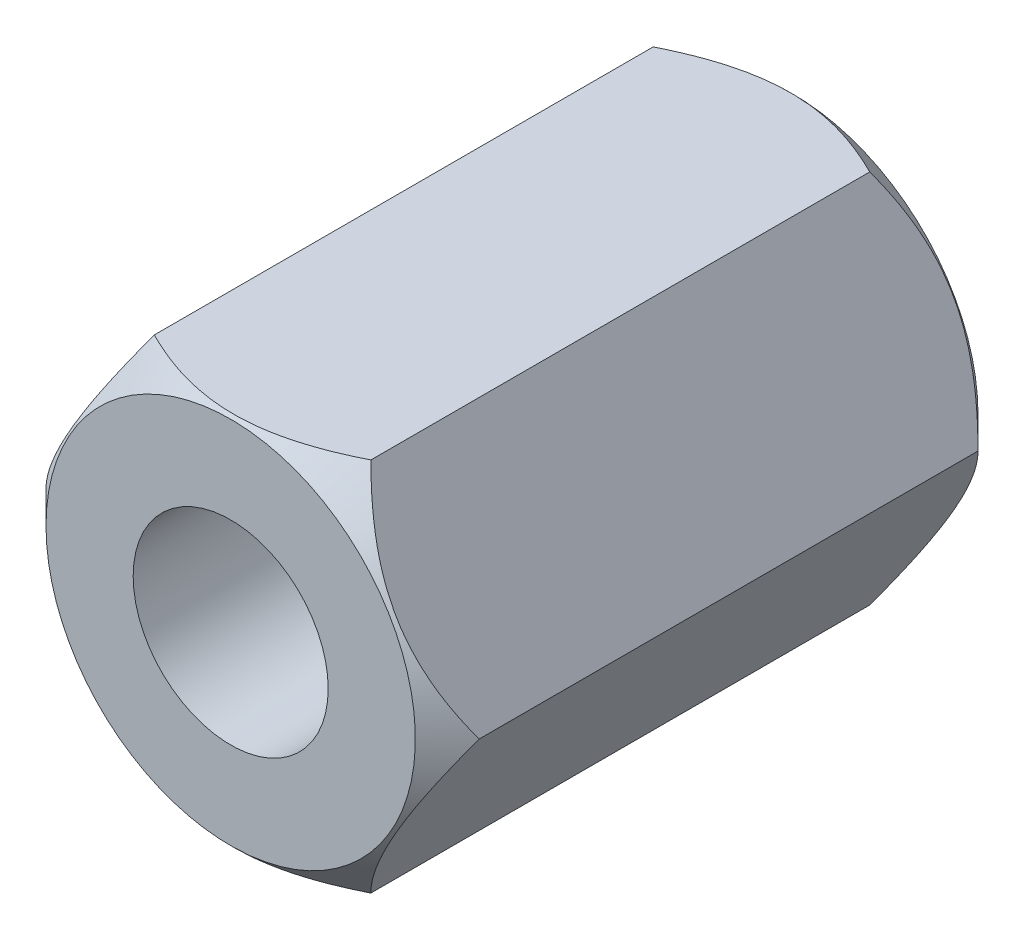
ISO-10303-21;
HEADER;
FILE_DESCRIPTION(('STEP AP214'),'2;1');
FILE_NAME('part.step','',(''),(''),'','','');
FILE_SCHEMA(('AUTOMOTIVE_DESIGN { 1 0 10303 214 1 1 1 1 }'));
ENDSEC;
DATA;
#1=APPLICATION_CONTEXT('core data for automotive mechanical design processes');
#2=APPLICATION_PROTOCOL_DEFINITION('international standard','automotive_design',2000,#1);
#3=PRODUCT_CONTEXT('',#1,'mechanical');
#4=PRODUCT('Part','Part','',(#3));
#5=PRODUCT_RELATED_PRODUCT_CATEGORY('part','',(#4));
#6=PRODUCT_DEFINITION_FORMATION('','',#4);
#7=PRODUCT_DEFINITION_CONTEXT('part definition',#1,'design');
#8=PRODUCT_DEFINITION('design','',#6,#7);
#9=PRODUCT_DEFINITION_SHAPE('','',#8);
#10=(LENGTH_UNIT() NAMED_UNIT(*) SI_UNIT(.MILLI.,.METRE.));
#11=(NAMED_UNIT(*) PLANE_ANGLE_UNIT() SI_UNIT($,.RADIAN.));
#12=(NAMED_UNIT(*) SI_UNIT($,.STERADIAN.) SOLID_ANGLE_UNIT());
#13=UNCERTAINTY_MEASURE_WITH_UNIT(LENGTH_MEASURE(1.E-05),#10,'distance_accuracy_value','');
#14=(GEOMETRIC_REPRESENTATION_CONTEXT(3) GLOBAL_UNCERTAINTY_ASSIGNED_CONTEXT((#13)) GLOBAL_UNIT_ASSIGNED_CONTEXT((#10,
#11,#12)) REPRESENTATION_CONTEXT('',''));
#15=CARTESIAN_POINT('',(0.,0.,0.));
#16=DIRECTION('',(0.,0.,1.));
#17=DIRECTION('',(1.,0.,0.));
#18=AXIS2_PLACEMENT_3D('',#15,#16,#17);
#19=CARTESIAN_POINT('',(0.,0.,-15.));
#20=DIRECTION('',(0.,0.,0.999999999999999));
#21=DIRECTION('',(1.,0.,0.));
#22=AXIS2_PLACEMENT_3D('',#19,#20,#21);
#23=CYLINDRICAL_SURFACE('',#22,2.6);
#24=CARTESIAN_POINT('',(0.,0.,-4.65000000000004));
#25=DIRECTION('',(0.,0.,-0.999999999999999));
#26=DIRECTION('',(-1.,0.,0.));
#27=AXIS2_PLACEMENT_3D('',#24,#25,#26);
#28=CIRCLE('',#27,2.6);
#29=CARTESIAN_POINT('',(2.6,0.,-4.65000000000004));
#30=VERTEX_POINT('',#29);
#31=EDGE_CURVE('E11',#30,#30,#28,.T.);
#32=CARTESIAN_POINT('',(0.,0.,0.));
#33=DIRECTION('',(0.,0.,0.999999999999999));
#34=DIRECTION('',(1.,0.,0.));
#35=AXIS2_PLACEMENT_3D('',#32,#33,#34);
#36=CIRCLE('',#35,2.6);
#37=CARTESIAN_POINT('',(2.6,0.,0.));
#38=VERTEX_POINT('',#37);
#39=EDGE_CURVE('E117',#38,#38,#36,.T.);
#40=CARTESIAN_POINT('',(2.6,0.,-4.65000000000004));
#41=CARTESIAN_POINT('',(2.6,0.,-4.60156250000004));
#42=CARTESIAN_POINT('',(2.6,0.,-4.55312500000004));
#43=CARTESIAN_POINT('',(2.6,0.,-4.45625000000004));
#44=CARTESIAN_POINT('',(2.6,0.,-4.40781250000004));
#45=CARTESIAN_POINT('',(2.6,0.,-4.31093750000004));
#46=CARTESIAN_POINT('',(2.6,0.,-4.26250000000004));
#47=CARTESIAN_POINT('',(2.6,0.,-4.16562500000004));
#48=CARTESIAN_POINT('',(2.6,0.,-4.11718750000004));
#49=CARTESIAN_POINT('',(2.6,0.,-4.02031250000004));
#50=CARTESIAN_POINT('',(2.6,0.,-3.97187500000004));
#51=CARTESIAN_POINT('',(2.6,0.,-3.87500000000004));
#52=CARTESIAN_POINT('',(2.6,0.,-3.82656250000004));
#53=CARTESIAN_POINT('',(2.6,0.,-3.72968750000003));
#54=CARTESIAN_POINT('',(2.6,0.,-3.68125000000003));
#55=CARTESIAN_POINT('',(2.6,0.,-3.58437500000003));
#56=CARTESIAN_POINT('',(2.6,0.,-3.53593750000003));
#57=CARTESIAN_POINT('',(2.6,0.,-3.43906250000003));
#58=CARTESIAN_POINT('',(2.6,0.,-3.39062500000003));
#59=CARTESIAN_POINT('',(2.6,0.,-3.29375000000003));
#60=CARTESIAN_POINT('',(2.6,0.,-3.24531250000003));
#61=CARTESIAN_POINT('',(2.6,0.,-3.14843750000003));
#62=CARTESIAN_POINT('',(2.6,0.,-3.10000000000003));
#63=CARTESIAN_POINT('',(2.6,0.,-3.00312500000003));
#64=CARTESIAN_POINT('',(2.6,0.,-2.95468750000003));
#65=CARTESIAN_POINT('',(2.6,0.,-2.85781250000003));
#66=CARTESIAN_POINT('',(2.6,0.,-2.80937500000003));
#67=CARTESIAN_POINT('',(2.6,0.,-2.71250000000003));
#68=CARTESIAN_POINT('',(2.6,0.,-2.66406250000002));
#69=CARTESIAN_POINT('',(2.6,0.,-2.56718750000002));
#70=CARTESIAN_POINT('',(2.6,0.,-2.51875000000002));
#71=CARTESIAN_POINT('',(2.6,0.,-2.42187500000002));
#72=CARTESIAN_POINT('',(2.6,0.,-2.37343750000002));
#73=CARTESIAN_POINT('',(2.6,0.,-2.27656250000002));
#74=CARTESIAN_POINT('',(2.6,0.,-2.22812500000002));
#75=CARTESIAN_POINT('',(2.6,0.,-2.13125000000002));
#76=CARTESIAN_POINT('',(2.6,0.,-2.08281250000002));
#77=CARTESIAN_POINT('',(2.6,0.,-1.98593750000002));
#78=CARTESIAN_POINT('',(2.6,0.,-1.93750000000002));
#79=CARTESIAN_POINT('',(2.6,0.,-1.84062500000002));
#80=CARTESIAN_POINT('',(2.6,0.,-1.79218750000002));
#81=CARTESIAN_POINT('',(2.6,0.,-1.69531250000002));
#82=CARTESIAN_POINT('',(2.6,0.,-1.64687500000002));
#83=CARTESIAN_POINT('',(2.6,0.,-1.55000000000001));
#84=CARTESIAN_POINT('',(2.6,0.,-1.50156250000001));
#85=CARTESIAN_POINT('',(2.6,0.,-1.40468750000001));
#86=CARTESIAN_POINT('',(2.6,0.,-1.35625000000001));
#87=CARTESIAN_POINT('',(2.6,0.,-1.25937500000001));
#88=CARTESIAN_POINT('',(2.6,0.,-1.21093750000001));
#89=CARTESIAN_POINT('',(2.6,0.,-1.11406250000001));
#90=CARTESIAN_POINT('',(2.6,0.,-1.06562500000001));
#91=CARTESIAN_POINT('',(2.6,0.,-0.968750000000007));
#92=CARTESIAN_POINT('',(2.6,0.,-0.920312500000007));
#93=CARTESIAN_POINT('',(2.6,0.,-0.823437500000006));
#94=CARTESIAN_POINT('',(2.6,0.,-0.775000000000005));
#95=CARTESIAN_POINT('',(2.6,0.,-0.678125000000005));
#96=CARTESIAN_POINT('',(2.6,0.,-0.629687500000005));
#97=CARTESIAN_POINT('',(2.6,0.,-0.532812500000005));
#98=CARTESIAN_POINT('',(2.6,0.,-0.484375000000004));
#99=CARTESIAN_POINT('',(2.6,0.,-0.387500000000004));
#100=CARTESIAN_POINT('',(2.6,0.,-0.339062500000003));
#101=CARTESIAN_POINT('',(2.6,0.,-0.242187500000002));
#102=CARTESIAN_POINT('',(2.6,0.,-0.193750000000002));
#103=CARTESIAN_POINT('',(2.6,0.,-0.0968750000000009));
#104=CARTESIAN_POINT('',(2.6,0.,-0.0484375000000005));
#105=CARTESIAN_POINT('',(2.6,0.,0.));
#106=B_SPLINE_CURVE_WITH_KNOTS('',3,(#40,#41,#42,#43,#44,#45,#46,#47,#48,#49,#50,#51,#52,#53,
#54,#55,#56,#57,#58,#59,#60,#61,#62,#63,#64,#65,#66,#67,#68,#69,#70,#71,#72,#73,#74,#75,#76,#77,
#78,#79,#80,#81,#82,#83,#84,#85,#86,#87,#88,#89,#90,#91,#92,#93,#94,#95,#96,#97,#98,#99,#100,
#101,#102,#103,#104,#105),.UNSPECIFIED.,.F.,.F.,(4,2,2,2,2,2,2,2,2,2,2,2,2,2,2,2,2,2,2,2,2,2,2,
2,2,2,2,2,2,2,2,2,4),(0.,0.145312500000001,0.290625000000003,0.435937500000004,
0.581250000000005,0.726562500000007,0.871875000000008,1.01718750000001,1.16250000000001,
1.30781250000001,1.45312500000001,1.59843750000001,1.74375000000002,1.88906250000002,
2.03437500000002,2.17968750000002,2.32500000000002,2.47031250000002,2.61562500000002,
2.76093750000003,2.90625000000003,3.05156250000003,3.19687500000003,3.34218750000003,
3.48750000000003,3.63281250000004,3.77812500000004,3.92343750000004,4.06875000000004,
4.21406250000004,4.35937500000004,4.50468750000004,4.65000000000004),.UNSPECIFIED.);
#107=EDGE_CURVE('BSEAM30',#30,#38,#106,.T.);
#108=ORIENTED_EDGE('',*,*,#31,.T.);
#109=ORIENTED_EDGE('',*,*,#39,.T.);
#110=ORIENTED_EDGE('',*,*,#107,.T.);
#111=ORIENTED_EDGE('',*,*,#107,.F.);
#112=EDGE_LOOP('',(#108,#110,#109,#111));
#113=FACE_BOUND('',#112,.T.);
#114=ADVANCED_FACE('F30',(#113),#23,.F.);
#115=CARTESIAN_POINT('',(-2.88675134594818,4.99999999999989,-15.));
#116=DIRECTION('',(-0.866025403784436,0.500000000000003,0.));
#117=DIRECTION('',(-0.500000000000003,-0.866025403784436,0.));
#118=AXIS2_PLACEMENT_3D('',#115,#116,#117);
#119=PLANE('',#118);
#120=CARTESIAN_POINT('',(-5.7736181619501,-0.000200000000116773,-14.1498845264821));
#121=CARTESIAN_POINT('',(-5.72398176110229,0.0857727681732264,-14.1995164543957));
#122=CARTESIAN_POINT('',(-5.67396382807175,0.172406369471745,-14.2476252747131));
#123=CARTESIAN_POINT('',(-5.57309004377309,0.347124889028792,-14.3403333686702));
#124=CARTESIAN_POINT('',(-5.52223375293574,0.435210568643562,-14.3849307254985));
#125=CARTESIAN_POINT('',(-5.36782257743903,0.702658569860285,-14.5131409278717));
#126=CARTESIAN_POINT('',(-5.26296050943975,0.884284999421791,-14.5906249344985));
#127=CARTESIAN_POINT('',(-5.05149774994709,1.25054924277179,-14.7233110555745));
#128=CARTESIAN_POINT('',(-4.94495110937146,1.43509343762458,-14.7788474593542));
#129=CARTESIAN_POINT('',(-4.78337944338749,1.71494377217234,-14.8430895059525));
#130=CARTESIAN_POINT('',(-4.7292843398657,1.80863923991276,-14.8613178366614));
#131=CARTESIAN_POINT('',(-4.62063609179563,1.9968235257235,-14.8910078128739));
#132=CARTESIAN_POINT('',(-4.56608301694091,2.09131222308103,-14.9024704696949));
#133=CARTESIAN_POINT('',(-4.43314578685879,2.32156625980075,-14.921689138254));
#134=CARTESIAN_POINT('',(-4.35461839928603,2.45757968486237,-14.9257217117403));
#135=CARTESIAN_POINT('',(-4.19770514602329,2.7293614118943,-14.9189541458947));
#136=CARTESIAN_POINT('',(-4.11931933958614,2.86512961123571,-14.908148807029));
#137=CARTESIAN_POINT('',(-3.96328672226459,3.13538603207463,-14.872342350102));
#138=CARTESIAN_POINT('',(-3.88564083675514,3.26987265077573,-14.8473253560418));
#139=CARTESIAN_POINT('',(-3.7316836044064,3.53653439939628,-14.7844556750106));
#140=CARTESIAN_POINT('',(-3.65537215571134,3.6687097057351,-14.7466039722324));
#141=CARTESIAN_POINT('',(-3.51990355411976,3.90334820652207,-14.6687301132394));
#142=CARTESIAN_POINT('',(-3.46044647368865,4.00633089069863,-14.630755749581));
#143=CARTESIAN_POINT('',(-3.34259967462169,4.21044753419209,-14.5486873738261));
#144=CARTESIAN_POINT('',(-3.284209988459,4.31158143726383,-14.5045931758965));
#145=CARTESIAN_POINT('',(-3.1686818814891,4.5116819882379,-14.4112736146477));
#146=CARTESIAN_POINT('',(-3.1115401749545,4.61065432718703,-14.3620643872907));
#147=CARTESIAN_POINT('',(-2.99831490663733,4.80676624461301,-14.259160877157));
#148=CARTESIAN_POINT('',(-2.94223072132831,4.90390690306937,-14.205469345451));
#149=CARTESIAN_POINT('',(-2.88663587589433,5.00020000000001,-14.1498845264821));
#150=B_SPLINE_CURVE_WITH_KNOTS('',3,(#120,#121,#122,#123,#124,#125,#126,#127,#128,#129,#130,
#131,#132,#133,#134,#135,#136,#137,#138,#139,#140,#141,#142,#143,#144,#145,#146,#147,#148,#149),
.UNSPECIFIED.,.F.,.F.,(4,2,2,2,2,2,2,2,2,2,2,2,2,2,4),(0.,0.332945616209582,0.666071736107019,
1.33592065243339,1.99513262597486,2.32409207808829,2.65300234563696,3.12358963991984,
3.59434188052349,4.06562104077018,4.53686407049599,4.91117956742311,5.28550643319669,
5.65868635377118,6.03163889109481),.UNSPECIFIED.);
#151=CARTESIAN_POINT('',(-5.77350269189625,0.,-14.15));
#152=VERTEX_POINT('',#151);
#153=CARTESIAN_POINT('',(-2.88675134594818,4.99999999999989,-14.15));
#154=VERTEX_POINT('',#153);
#155=EDGE_CURVE('E182',#152,#154,#150,.T.);
#156=ORIENTED_EDGE('',*,*,#155,.F.);
#157=DIRECTION('',(0.,0.,0.999999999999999));
#158=VECTOR('',#157,1.);
#159=CARTESIAN_POINT('',(-5.77350269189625,0.,-15.));
#160=LINE('',#159,#158);
#161=CARTESIAN_POINT('',(-5.77350269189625,0.,-0.850000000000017));
#162=VERTEX_POINT('',#161);
#163=EDGE_CURVE('E54',#152,#162,#160,.T.);
#164=ORIENTED_EDGE('',*,*,#163,.T.);
#165=CARTESIAN_POINT('',(-5.7736181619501,-0.000200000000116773,-0.850115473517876));
#166=CARTESIAN_POINT('',(-5.72398176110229,0.0857727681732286,-0.8004835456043));
#167=CARTESIAN_POINT('',(-5.67396382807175,0.172406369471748,-0.752374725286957));
#168=CARTESIAN_POINT('',(-5.57309004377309,0.347124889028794,-0.659666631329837));
#169=CARTESIAN_POINT('',(-5.52223375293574,0.435210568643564,-0.615069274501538));
#170=CARTESIAN_POINT('',(-5.36782257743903,0.702658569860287,-0.486859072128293));
#171=CARTESIAN_POINT('',(-5.26296050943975,0.884284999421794,-0.409375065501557));
#172=CARTESIAN_POINT('',(-5.05149774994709,1.2505492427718,-0.276688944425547));
#173=CARTESIAN_POINT('',(-4.94495110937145,1.43509343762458,-0.221152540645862));
#174=CARTESIAN_POINT('',(-4.78337944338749,1.71494377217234,-0.156910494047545));
#175=CARTESIAN_POINT('',(-4.7292843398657,1.80863923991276,-0.138682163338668));
#176=CARTESIAN_POINT('',(-4.62063609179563,1.9968235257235,-0.108992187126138));
#177=CARTESIAN_POINT('',(-4.56608301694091,2.09131222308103,-0.0975295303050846));
#178=CARTESIAN_POINT('',(-4.43314578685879,2.32156625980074,-0.0783108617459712));
#179=CARTESIAN_POINT('',(-4.35461839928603,2.45757968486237,-0.0742782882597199));
#180=CARTESIAN_POINT('',(-4.19770514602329,2.7293614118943,-0.0810458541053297));
#181=CARTESIAN_POINT('',(-4.11931933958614,2.86512961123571,-0.0918511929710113));
#182=CARTESIAN_POINT('',(-3.96328672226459,3.13538603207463,-0.127657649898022));
#183=CARTESIAN_POINT('',(-3.88564083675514,3.26987265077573,-0.152674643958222));
#184=CARTESIAN_POINT('',(-3.7316836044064,3.53653439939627,-0.215544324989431));
#185=CARTESIAN_POINT('',(-3.65537215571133,3.6687097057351,-0.253396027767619));
#186=CARTESIAN_POINT('',(-3.51990355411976,3.90334820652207,-0.331269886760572));
#187=CARTESIAN_POINT('',(-3.46044647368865,4.00633089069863,-0.369244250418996));
#188=CARTESIAN_POINT('',(-3.3425996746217,4.21044753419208,-0.451312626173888));
#189=CARTESIAN_POINT('',(-3.284209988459,4.31158143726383,-0.495406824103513));
#190=CARTESIAN_POINT('',(-3.1686818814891,4.51168198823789,-0.588726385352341));
#191=CARTESIAN_POINT('',(-3.1115401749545,4.61065432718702,-0.637935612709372));
#192=CARTESIAN_POINT('',(-2.99831490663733,4.80676624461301,-0.740839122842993));
#193=CARTESIAN_POINT('',(-2.94223072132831,4.90390690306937,-0.794530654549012));
#194=CARTESIAN_POINT('',(-2.88663587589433,5.00020000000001,-0.850115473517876));
#195=B_SPLINE_CURVE_WITH_KNOTS('',3,(#165,#166,#167,#168,#169,#170,#171,#172,#173,#174,#175,
#176,#177,#178,#179,#180,#181,#182,#183,#184,#185,#186,#187,#188,#189,#190,#191,#192,#193,#194),
.UNSPECIFIED.,.F.,.F.,(4,2,2,2,2,2,2,2,2,2,2,2,2,2,4),(0.,0.332945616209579,0.666071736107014,
1.33592065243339,1.99513262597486,2.32409207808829,2.65300234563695,3.12358963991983,
3.59434188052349,4.06562104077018,4.53686407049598,4.91117956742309,5.28550643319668,
5.65868635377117,6.0316388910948),.UNSPECIFIED.);
#196=CARTESIAN_POINT('',(-2.88675134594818,4.99999999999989,-0.850000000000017));
#197=VERTEX_POINT('',#196);
#198=EDGE_CURVE('E235',#162,#197,#195,.T.);
#199=ORIENTED_EDGE('',*,*,#198,.T.);
#200=DIRECTION('',(0.,0.,0.999999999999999));
#201=VECTOR('',#200,1.);
#202=CARTESIAN_POINT('',(-2.88675134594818,4.99999999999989,-15.));
#203=LINE('',#202,#201);
#204=EDGE_CURVE('E109',#154,#197,#203,.T.);
#205=ORIENTED_EDGE('',*,*,#204,.F.);
#206=EDGE_LOOP('',(#156,#164,#199,#205));
#207=FACE_BOUND('',#206,.T.);
#208=ADVANCED_FACE('F32',(#207),#119,.T.);
#209=CARTESIAN_POINT('',(-2.88675134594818,4.99999999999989,-15.));
#210=DIRECTION('',(0.,-1.,0.));
#211=DIRECTION('',(1.,0.,0.));
#212=AXIS2_PLACEMENT_3D('',#209,#210,#211);
#213=PLANE('',#212);
#214=DIRECTION('',(0.,0.,0.999999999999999));
#215=VECTOR('',#214,1.);
#216=CARTESIAN_POINT('',(2.88675134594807,4.99999999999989,-15.));
#217=LINE('',#216,#215);
#218=CARTESIAN_POINT('',(2.88675134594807,4.99999999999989,-14.15));
#219=VERTEX_POINT('',#218);
#220=CARTESIAN_POINT('',(2.88675134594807,4.99999999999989,-0.850000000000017));
#221=VERTEX_POINT('',#220);
#222=EDGE_CURVE('E107',#219,#221,#217,.T.);
#223=ORIENTED_EDGE('',*,*,#222,.F.);
#224=CARTESIAN_POINT('',(-5.99357629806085,4.99999999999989,-12.1181867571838));
#225=CARTESIAN_POINT('',(-5.84865465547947,4.9999999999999,-12.2294447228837));
#226=CARTESIAN_POINT('',(-5.7029486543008,4.9999999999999,-12.3396971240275));
#227=CARTESIAN_POINT('',(-5.40964860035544,4.9999999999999,-12.5577324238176));
#228=CARTESIAN_POINT('',(-5.26205410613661,4.99999999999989,-12.6655147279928));
#229=CARTESIAN_POINT('',(-4.96357882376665,4.99999999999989,-12.8789185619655));
#230=CARTESIAN_POINT('',(-4.81268146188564,4.99999999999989,-12.9845169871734));
#231=CARTESIAN_POINT('',(-4.50836938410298,4.99999999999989,-13.1920096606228));
#232=CARTESIAN_POINT('',(-4.35495484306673,4.99999999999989,-13.2939041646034));
#233=CARTESIAN_POINT('',(-4.03547909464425,4.99999999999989,-13.4993919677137));
#234=CARTESIAN_POINT('',(-3.86922792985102,4.99999999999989,-13.6026914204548));
#235=CARTESIAN_POINT('',(-3.53282354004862,4.99999999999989,-13.8028363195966));
#236=CARTESIAN_POINT('',(-3.36266966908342,4.99999999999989,-13.8996806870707));
#237=CARTESIAN_POINT('',(-3.01842041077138,4.99999999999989,-14.0848498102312));
#238=CARTESIAN_POINT('',(-2.84433858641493,4.99999999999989,-14.1731995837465));
#239=CARTESIAN_POINT('',(-2.49127297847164,4.99999999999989,-14.3394001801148));
#240=CARTESIAN_POINT('',(-2.31229154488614,4.99999999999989,-14.4172559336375));
#241=CARTESIAN_POINT('',(-1.96661147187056,4.99999999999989,-14.5527670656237));
#242=CARTESIAN_POINT('',(-1.80039807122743,4.9999999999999,-14.6116476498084));
#243=CARTESIAN_POINT('',(-1.46376298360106,4.99999999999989,-14.7161017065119));
#244=CARTESIAN_POINT('',(-1.29334102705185,4.99999999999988,-14.7616743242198));
#245=CARTESIAN_POINT('',(-0.952259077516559,4.99999999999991,-14.8362965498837));
#246=CARTESIAN_POINT('',(-0.781665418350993,4.99999999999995,-14.8656442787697));
#247=CARTESIAN_POINT('',(-0.438392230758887,4.99999999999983,-14.9072089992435));
#248=CARTESIAN_POINT('',(-0.26571313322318,4.99999999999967,-14.9194294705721));
#249=CARTESIAN_POINT('',(0.0725822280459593,4.99999999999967,-14.9257137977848));
#250=CARTESIAN_POINT('',(0.238184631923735,4.99999999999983,-14.9205319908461));
#251=CARTESIAN_POINT('',(0.568083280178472,4.99999999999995,-14.8940226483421));
#252=CARTESIAN_POINT('',(0.732379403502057,4.99999999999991,-14.8726936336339));
#253=CARTESIAN_POINT('',(1.06125983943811,4.99999999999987,-14.8147284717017));
#254=CARTESIAN_POINT('',(1.22579591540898,4.99999999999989,-14.7778232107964));
#255=CARTESIAN_POINT('',(1.55124956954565,4.9999999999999,-14.6907438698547));
#256=CARTESIAN_POINT('',(1.71216736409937,4.9999999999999,-14.6405705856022));
#257=CARTESIAN_POINT('',(2.03985820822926,4.99999999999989,-14.525722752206));
#258=CARTESIAN_POINT('',(2.20638233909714,4.99999999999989,-14.4603459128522));
#259=CARTESIAN_POINT('',(2.53514333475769,4.99999999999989,-14.319497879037));
#260=CARTESIAN_POINT('',(2.69737821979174,4.99999999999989,-14.2440221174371));
#261=CARTESIAN_POINT('',(3.01832951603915,4.99999999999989,-14.084766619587));
#262=CARTESIAN_POINT('',(3.1770331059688,4.99999999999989,-14.0009612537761));
#263=CARTESIAN_POINT('',(3.49080217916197,4.99999999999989,-13.8268916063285));
#264=CARTESIAN_POINT('',(3.64586821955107,4.99999999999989,-13.7366283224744));
#265=CARTESIAN_POINT('',(3.94525494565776,4.99999999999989,-13.5554929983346));
#266=CARTESIAN_POINT('',(4.08972797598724,4.99999999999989,-13.4648714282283));
#267=CARTESIAN_POINT('',(4.37619203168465,4.99999999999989,-13.2797753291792));
#268=CARTESIAN_POINT('',(4.51818286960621,4.99999999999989,-13.1853005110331));
#269=CARTESIAN_POINT('',(4.79886466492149,4.99999999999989,-12.9939554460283));
#270=CARTESIAN_POINT('',(4.93757297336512,4.99999999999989,-12.8971105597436));
#271=CARTESIAN_POINT('',(5.21308736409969,4.99999999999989,-12.7008280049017));
#272=CARTESIAN_POINT('',(5.34989396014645,4.99999999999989,-12.6013910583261));
#273=CARTESIAN_POINT('',(5.48590295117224,4.99999999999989,-12.5008932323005));
#274=B_SPLINE_CURVE_WITH_KNOTS('',3,(#224,#225,#226,#227,#228,#229,#230,#231,#232,#233,#234,
#235,#236,#237,#238,#239,#240,#241,#242,#243,#244,#245,#246,#247,#248,#249,#250,#251,#252,#253,
#254,#255,#256,#257,#258,#259,#260,#261,#262,#263,#264,#265,#266,#267,#268,#269,#270,#271,#272,
#273),.UNSPECIFIED.,.F.,.F.,(4,2,2,2,2,2,2,2,2,2,2,2,2,2,2,2,2,2,2,2,2,2,2,2,4),(0.,
0.548121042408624,1.09637264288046,1.64885671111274,2.20130256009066,2.78837599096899,
3.37554730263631,3.96093263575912,4.5460419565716,5.0745882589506,5.60316850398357,
6.12168301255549,6.64009215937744,7.13632490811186,7.63260311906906,8.13783126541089,
8.6430291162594,9.17931060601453,9.71583544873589,10.2540654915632,10.7922125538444,
11.3037682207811,11.8153623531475,12.3228440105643,12.8301857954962),.UNSPECIFIED.);
#275=EDGE_CURVE('E90',#219,#154,#274,.F.);
#276=ORIENTED_EDGE('',*,*,#275,.T.);
#277=ORIENTED_EDGE('',*,*,#204,.T.);
#278=CARTESIAN_POINT('',(-5.99357629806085,4.99999999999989,-2.88181324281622));
#279=CARTESIAN_POINT('',(-5.84865465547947,4.9999999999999,-2.77055527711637));
#280=CARTESIAN_POINT('',(-5.7029486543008,4.9999999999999,-2.6603028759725));
#281=CARTESIAN_POINT('',(-5.40964860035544,4.9999999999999,-2.44226757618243));
#282=CARTESIAN_POINT('',(-5.26205410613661,4.99999999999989,-2.33448527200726));
#283=CARTESIAN_POINT('',(-4.96357882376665,4.99999999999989,-2.12108143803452));
#284=CARTESIAN_POINT('',(-4.81268146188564,4.99999999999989,-2.01548301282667));
#285=CARTESIAN_POINT('',(-4.50836938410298,4.99999999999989,-1.80799033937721));
#286=CARTESIAN_POINT('',(-4.35495484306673,4.99999999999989,-1.70609583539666));
#287=CARTESIAN_POINT('',(-4.03547909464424,4.99999999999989,-1.50060803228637));
#288=CARTESIAN_POINT('',(-3.86922792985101,4.99999999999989,-1.3973085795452));
#289=CARTESIAN_POINT('',(-3.53282354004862,4.99999999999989,-1.19716368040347));
#290=CARTESIAN_POINT('',(-3.36266966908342,4.99999999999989,-1.10031931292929));
#291=CARTESIAN_POINT('',(-3.01842041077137,4.99999999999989,-0.915150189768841));
#292=CARTESIAN_POINT('',(-2.84433858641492,4.99999999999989,-0.82680041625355));
#293=CARTESIAN_POINT('',(-2.49127297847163,4.99999999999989,-0.660599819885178));
#294=CARTESIAN_POINT('',(-2.31229154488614,4.99999999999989,-0.58274406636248));
#295=CARTESIAN_POINT('',(-1.96661147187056,4.99999999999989,-0.447232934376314));
#296=CARTESIAN_POINT('',(-1.80039807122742,4.9999999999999,-0.388352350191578));
#297=CARTESIAN_POINT('',(-1.46376298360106,4.99999999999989,-0.283898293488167));
#298=CARTESIAN_POINT('',(-1.29334102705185,4.99999999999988,-0.238325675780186));
#299=CARTESIAN_POINT('',(-0.952259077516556,4.99999999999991,-0.163703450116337));
#300=CARTESIAN_POINT('',(-0.78166541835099,4.99999999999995,-0.134355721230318));
#301=CARTESIAN_POINT('',(-0.438392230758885,4.99999999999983,-0.0927910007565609));
#302=CARTESIAN_POINT('',(-0.265713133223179,4.99999999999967,-0.0805705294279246));
#303=CARTESIAN_POINT('',(0.072582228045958,4.99999999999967,-0.0742862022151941));
#304=CARTESIAN_POINT('',(0.238184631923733,4.99999999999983,-0.0794680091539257));
#305=CARTESIAN_POINT('',(0.568083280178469,4.99999999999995,-0.105977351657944));
#306=CARTESIAN_POINT('',(0.732379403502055,4.99999999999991,-0.127306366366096));
#307=CARTESIAN_POINT('',(1.06125983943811,4.99999999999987,-0.185271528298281));
#308=CARTESIAN_POINT('',(1.22579591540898,4.99999999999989,-0.222176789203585));
#309=CARTESIAN_POINT('',(1.55124956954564,4.9999999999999,-0.309256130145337));
#310=CARTESIAN_POINT('',(1.71216736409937,4.9999999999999,-0.359429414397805));
#311=CARTESIAN_POINT('',(2.03985820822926,4.99999999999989,-0.474277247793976));
#312=CARTESIAN_POINT('',(2.20638233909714,4.99999999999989,-0.539654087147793));
#313=CARTESIAN_POINT('',(2.53514333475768,4.99999999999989,-0.680502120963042));
#314=CARTESIAN_POINT('',(2.69737821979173,4.99999999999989,-0.755977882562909));
#315=CARTESIAN_POINT('',(3.01832951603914,4.99999999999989,-0.915233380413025));
#316=CARTESIAN_POINT('',(3.17703310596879,4.99999999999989,-0.999038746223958));
#317=CARTESIAN_POINT('',(3.49080217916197,4.99999999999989,-1.17310839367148));
#318=CARTESIAN_POINT('',(3.64586821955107,4.99999999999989,-1.26337167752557));
#319=CARTESIAN_POINT('',(3.94525494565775,4.99999999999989,-1.44450700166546));
#320=CARTESIAN_POINT('',(4.08972797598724,4.99999999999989,-1.53512857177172));
#321=CARTESIAN_POINT('',(4.37619203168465,4.99999999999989,-1.7202246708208));
#322=CARTESIAN_POINT('',(4.51818286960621,4.99999999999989,-1.81469948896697));
#323=CARTESIAN_POINT('',(4.79886466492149,4.99999999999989,-2.00604455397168));
#324=CARTESIAN_POINT('',(4.93757297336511,4.99999999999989,-2.10288944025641));
#325=CARTESIAN_POINT('',(5.21308736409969,4.99999999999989,-2.29917199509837));
#326=CARTESIAN_POINT('',(5.34989396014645,4.99999999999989,-2.39860894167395));
#327=CARTESIAN_POINT('',(5.48590295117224,4.99999999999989,-2.49910676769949));
#328=B_SPLINE_CURVE_WITH_KNOTS('',3,(#278,#279,#280,#281,#282,#283,#284,#285,#286,#287,#288,
#289,#290,#291,#292,#293,#294,#295,#296,#297,#298,#299,#300,#301,#302,#303,#304,#305,#306,#307,
#308,#309,#310,#311,#312,#313,#314,#315,#316,#317,#318,#319,#320,#321,#322,#323,#324,#325,#326,
#327),.UNSPECIFIED.,.F.,.F.,(4,2,2,2,2,2,2,2,2,2,2,2,2,2,2,2,2,2,2,2,2,2,2,2,4),(0.,
0.548121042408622,1.09637264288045,1.64885671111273,2.20130256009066,2.78837599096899,
3.37554730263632,3.96093263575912,4.5460419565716,5.0745882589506,5.60316850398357,
6.12168301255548,6.64009215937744,7.13632490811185,7.63260311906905,8.13783126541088,
8.64302911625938,9.17931060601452,9.71583544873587,10.2540654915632,10.7922125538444,
11.3037682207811,11.8153623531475,12.3228440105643,12.8301857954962),.UNSPECIFIED.);
#329=EDGE_CURVE('E171',#221,#197,#328,.F.);
#330=ORIENTED_EDGE('',*,*,#329,.F.);
#331=EDGE_LOOP('',(#223,#276,#277,#330));
#332=FACE_BOUND('',#331,.T.);
#333=ADVANCED_FACE('F147',(#332),#213,.F.);
#334=CARTESIAN_POINT('',(2.88675134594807,4.99999999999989,-15.));
#335=DIRECTION('',(-0.86602540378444,-0.499999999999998,0.));
#336=DIRECTION('',(0.499999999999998,-0.86602540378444,0.));
#337=AXIS2_PLACEMENT_3D('',#334,#335,#336);
#338=PLANE('',#337);
#339=DIRECTION('',(0.,0.,0.999999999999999));
#340=VECTOR('',#339,1.);
#341=CARTESIAN_POINT('',(5.77350269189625,0.,-15.));
#342=LINE('',#341,#340);
#343=CARTESIAN_POINT('',(5.77350269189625,0.,-14.15));
#344=VERTEX_POINT('',#343);
#345=CARTESIAN_POINT('',(5.77350269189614,-2.22044604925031E-13,-0.850000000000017));
#346=VERTEX_POINT('',#345);
#347=EDGE_CURVE('E99',#344,#346,#342,.T.);
#348=ORIENTED_EDGE('',*,*,#347,.F.);
#349=CARTESIAN_POINT('',(5.77361816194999,-0.000200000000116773,-14.1498845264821));
#350=CARTESIAN_POINT('',(5.72398176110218,0.0857727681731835,-14.1995164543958));
#351=CARTESIAN_POINT('',(5.67396382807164,0.172406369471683,-14.2476252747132));
#352=CARTESIAN_POINT('',(5.57309004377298,0.34712488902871,-14.3403333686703));
#353=CARTESIAN_POINT('',(5.52223375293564,0.435210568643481,-14.3849307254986));
#354=CARTESIAN_POINT('',(5.36782257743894,0.70265856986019,-14.5131409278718));
#355=CARTESIAN_POINT('',(5.26296050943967,0.884284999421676,-14.5906249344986));
#356=CARTESIAN_POINT('',(5.05149774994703,1.25054924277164,-14.7233110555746));
#357=CARTESIAN_POINT('',(4.9449511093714,1.43509343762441,-14.7788474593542));
#358=CARTESIAN_POINT('',(4.78337944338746,1.71494377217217,-14.8430895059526));
#359=CARTESIAN_POINT('',(4.72928433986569,1.80863923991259,-14.8613178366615));
#360=CARTESIAN_POINT('',(4.62063609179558,1.99682352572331,-14.891007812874));
#361=CARTESIAN_POINT('',(4.56608301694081,2.09131222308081,-14.9024704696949));
#362=CARTESIAN_POINT('',(4.43314578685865,2.32156625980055,-14.921689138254));
#363=CARTESIAN_POINT('',(4.35461839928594,2.45757968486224,-14.9257217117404));
#364=CARTESIAN_POINT('',(4.19770514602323,2.72936141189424,-14.9189541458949));
#365=CARTESIAN_POINT('',(4.11931933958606,2.86512961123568,-14.9081488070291));
#366=CARTESIAN_POINT('',(3.96328672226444,3.13538603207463,-14.8723423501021));
#367=CARTESIAN_POINT('',(3.88564083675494,3.26987265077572,-14.8473253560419));
#368=CARTESIAN_POINT('',(3.73168360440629,3.53653439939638,-14.7844556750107));
#369=CARTESIAN_POINT('',(3.65537215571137,3.66870970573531,-14.7466039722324));
#370=CARTESIAN_POINT('',(3.51990355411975,3.90334820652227,-14.6687301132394));
#371=CARTESIAN_POINT('',(3.46044647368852,4.00633089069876,-14.6307557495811));
#372=CARTESIAN_POINT('',(3.34259967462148,4.21044753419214,-14.5486873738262));
#373=CARTESIAN_POINT('',(3.28420998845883,4.31158143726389,-14.5045931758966));
#374=CARTESIAN_POINT('',(3.16868188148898,4.51168198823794,-14.4112736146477));
#375=CARTESIAN_POINT('',(3.11154017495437,4.61065432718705,-14.3620643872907));
#376=CARTESIAN_POINT('',(2.99831490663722,4.80676624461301,-14.2591608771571));
#377=CARTESIAN_POINT('',(2.94223072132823,4.90390690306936,-14.2054693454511));
#378=CARTESIAN_POINT('',(2.88663587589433,5.00020000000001,-14.1498845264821));
#379=B_SPLINE_CURVE_WITH_KNOTS('',3,(#349,#350,#351,#352,#353,#354,#355,#356,#357,#358,#359,
#360,#361,#362,#363,#364,#365,#366,#367,#368,#369,#370,#371,#372,#373,#374,#375,#376,#377,#378),
.UNSPECIFIED.,.F.,.F.,(4,2,2,2,2,2,2,2,2,2,2,2,2,2,4),(0.,0.332945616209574,0.666071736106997,
1.3359206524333,1.99513262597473,2.32409207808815,2.65300234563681,3.12358963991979,
3.59434188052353,4.0656210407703,4.53686407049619,4.91117956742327,5.28550643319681,
5.65868635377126,6.03163889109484),.UNSPECIFIED.);
#380=EDGE_CURVE('E84',#344,#219,#379,.T.);
#381=ORIENTED_EDGE('',*,*,#380,.T.);
#382=ORIENTED_EDGE('',*,*,#222,.T.);
#383=CARTESIAN_POINT('',(5.77361816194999,-0.000200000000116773,-0.850115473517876));
#384=CARTESIAN_POINT('',(5.72398176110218,0.0857727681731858,-0.800483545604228));
#385=CARTESIAN_POINT('',(5.67396382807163,0.172406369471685,-0.752374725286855));
#386=CARTESIAN_POINT('',(5.57309004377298,0.347124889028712,-0.659666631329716));
#387=CARTESIAN_POINT('',(5.52223375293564,0.435210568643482,-0.615069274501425));
#388=CARTESIAN_POINT('',(5.36782257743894,0.702658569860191,-0.4868590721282));
#389=CARTESIAN_POINT('',(5.26296050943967,0.884284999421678,-0.409375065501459));
#390=CARTESIAN_POINT('',(5.05149774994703,1.25054924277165,-0.27668894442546));
#391=CARTESIAN_POINT('',(4.94495110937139,1.43509343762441,-0.221152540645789));
#392=CARTESIAN_POINT('',(4.78337944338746,1.71494377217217,-0.156910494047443));
#393=CARTESIAN_POINT('',(4.72928433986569,1.80863923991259,-0.138682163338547));
#394=CARTESIAN_POINT('',(4.62063609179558,1.99682352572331,-0.108992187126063));
#395=CARTESIAN_POINT('',(4.56608301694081,2.09131222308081,-0.0975295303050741));
#396=CARTESIAN_POINT('',(4.43314578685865,2.32156625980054,-0.0783108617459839));
#397=CARTESIAN_POINT('',(4.35461839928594,2.45757968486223,-0.0742782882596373));
#398=CARTESIAN_POINT('',(4.19770514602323,2.72936141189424,-0.0810458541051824));
#399=CARTESIAN_POINT('',(4.11931933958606,2.86512961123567,-0.0918511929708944));
#400=CARTESIAN_POINT('',(3.96328672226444,3.13538603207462,-0.127657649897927));
#401=CARTESIAN_POINT('',(3.88564083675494,3.26987265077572,-0.152674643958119));
#402=CARTESIAN_POINT('',(3.73168360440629,3.53653439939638,-0.21554432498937));
#403=CARTESIAN_POINT('',(3.65537215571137,3.66870970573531,-0.253396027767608));
#404=CARTESIAN_POINT('',(3.51990355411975,3.90334820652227,-0.33126988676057));
#405=CARTESIAN_POINT('',(3.46044647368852,4.00633089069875,-0.369244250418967));
#406=CARTESIAN_POINT('',(3.34259967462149,4.21044753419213,-0.451312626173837));
#407=CARTESIAN_POINT('',(3.28420998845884,4.31158143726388,-0.495406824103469));
#408=CARTESIAN_POINT('',(3.16868188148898,4.51168198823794,-0.588726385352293));
#409=CARTESIAN_POINT('',(3.11154017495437,4.61065432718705,-0.637935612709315));
#410=CARTESIAN_POINT('',(2.99831490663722,4.80676624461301,-0.740839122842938));
#411=CARTESIAN_POINT('',(2.94223072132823,4.90390690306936,-0.79453065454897));
#412=CARTESIAN_POINT('',(2.88663587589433,5.00020000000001,-0.850115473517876));
#413=B_SPLINE_CURVE_WITH_KNOTS('',3,(#383,#384,#385,#386,#387,#388,#389,#390,#391,#392,#393,
#394,#395,#396,#397,#398,#399,#400,#401,#402,#403,#404,#405,#406,#407,#408,#409,#410,#411,#412),
.UNSPECIFIED.,.F.,.F.,(4,2,2,2,2,2,2,2,2,2,2,2,2,2,4),(0.,0.33294561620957,0.666071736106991,
1.3359206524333,1.99513262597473,2.32409207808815,2.65300234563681,3.12358963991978,
3.59434188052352,4.06562104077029,4.53686407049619,4.91117956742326,5.2855064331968,
5.65868635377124,6.03163889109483),.UNSPECIFIED.);
#414=EDGE_CURVE('E106',#346,#221,#413,.T.);
#415=ORIENTED_EDGE('',*,*,#414,.F.);
#416=EDGE_LOOP('',(#348,#381,#382,#415));
#417=FACE_BOUND('',#416,.T.);
#418=ADVANCED_FACE('F104',(#417),#338,.F.);
#419=CARTESIAN_POINT('',(5.77350269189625,0.,-15.));
#420=DIRECTION('',(-0.866025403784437,0.500000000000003,0.));
#421=DIRECTION('',(-0.500000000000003,-0.866025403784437,0.));
#422=AXIS2_PLACEMENT_3D('',#419,#420,#421);
#423=PLANE('',#422);
#424=DIRECTION('',(0.,0.,0.999999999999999));
#425=VECTOR('',#424,1.);
#426=CARTESIAN_POINT('',(2.88675134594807,-5.00000000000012,-15.));
#427=LINE('',#426,#425);
#428=CARTESIAN_POINT('',(2.88675134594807,-5.00000000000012,-14.15));
#429=VERTEX_POINT('',#428);
#430=CARTESIAN_POINT('',(2.88675134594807,-5.00000000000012,-0.850000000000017));
#431=VERTEX_POINT('',#430);
#432=EDGE_CURVE('E101',#429,#431,#427,.T.);
#433=ORIENTED_EDGE('',*,*,#432,.F.);
#434=CARTESIAN_POINT('',(2.88663587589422,-5.00020000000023,-14.1498845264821));
#435=CARTESIAN_POINT('',(2.93627227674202,-4.91422723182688,-14.1995164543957));
#436=CARTESIAN_POINT('',(2.98629020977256,-4.82759363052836,-14.247625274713));
#437=CARTESIAN_POINT('',(3.08716399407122,-4.65287511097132,-14.3403333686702));
#438=CARTESIAN_POINT('',(3.13802028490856,-4.56478943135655,-14.3849307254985));
#439=CARTESIAN_POINT('',(3.29243146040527,-4.29734143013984,-14.5131409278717));
#440=CARTESIAN_POINT('',(3.39729352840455,-4.11571500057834,-14.5906249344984));
#441=CARTESIAN_POINT('',(3.6087562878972,-3.74945075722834,-14.7233110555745));
#442=CARTESIAN_POINT('',(3.71530292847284,-3.56490656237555,-14.7788474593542));
#443=CARTESIAN_POINT('',(3.87687459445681,-3.28505622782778,-14.8430895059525));
#444=CARTESIAN_POINT('',(3.93096969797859,-3.19136076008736,-14.8613178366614));
#445=CARTESIAN_POINT('',(4.03961794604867,-3.00317647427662,-14.8910078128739));
#446=CARTESIAN_POINT('',(4.09417102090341,-2.90868777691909,-14.9024704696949));
#447=CARTESIAN_POINT('',(4.22710825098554,-2.67843374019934,-14.921689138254));
#448=CARTESIAN_POINT('',(4.30563563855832,-2.54242031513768,-14.9257217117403));
#449=CARTESIAN_POINT('',(4.46254889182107,-2.27063858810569,-14.9189541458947));
#450=CARTESIAN_POINT('',(4.54093469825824,-2.13487038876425,-14.908148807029));
#451=CARTESIAN_POINT('',(4.69696731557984,-1.86461396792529,-14.872342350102));
#452=CARTESIAN_POINT('',(4.77461320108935,-1.73012734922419,-14.8473253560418));
#453=CARTESIAN_POINT('',(4.92857043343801,-1.46346560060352,-14.7844556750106));
#454=CARTESIAN_POINT('',(5.00488188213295,-1.33129029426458,-14.7466039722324));
#455=CARTESIAN_POINT('',(5.14035048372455,-1.09665179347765,-14.6687301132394));
#456=CARTESIAN_POINT('',(5.19980756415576,-0.9936691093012,-14.630755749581));
#457=CARTESIAN_POINT('',(5.31765436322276,-0.78955246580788,-14.5486873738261));
#458=CARTESIAN_POINT('',(5.37604404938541,-0.688418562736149,-14.5045931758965));
#459=CARTESIAN_POINT('',(5.49157215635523,-0.48831801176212,-14.4112736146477));
#460=CARTESIAN_POINT('',(5.54871386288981,-0.389345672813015,-14.3620643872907));
#461=CARTESIAN_POINT('',(5.66193913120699,-0.193233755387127,-14.2591608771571));
#462=CARTESIAN_POINT('',(5.71802331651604,-0.0960930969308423,-14.2054693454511));
#463=CARTESIAN_POINT('',(5.7736181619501,0.000199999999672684,-14.1498845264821));
#464=B_SPLINE_CURVE_WITH_KNOTS('',3,(#434,#435,#436,#437,#438,#439,#440,#441,#442,#443,#444,
#445,#446,#447,#448,#449,#450,#451,#452,#453,#454,#455,#456,#457,#458,#459,#460,#461,#462,#463),
.UNSPECIFIED.,.F.,.F.,(4,2,2,2,2,2,2,2,2,2,2,2,2,2,4),(0.,0.332945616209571,0.666071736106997,
1.33592065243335,1.99513262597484,2.32409207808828,2.65300234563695,3.12358963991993,
3.59434188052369,4.06562104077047,4.53686407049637,4.91117956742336,5.28550643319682,
5.6586863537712,6.0316388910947),.UNSPECIFIED.);
#465=EDGE_CURVE('E88',#429,#344,#464,.T.);
#466=ORIENTED_EDGE('',*,*,#465,.T.);
#467=ORIENTED_EDGE('',*,*,#347,.T.);
#468=CARTESIAN_POINT('',(2.88663587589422,-5.00020000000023,-0.850115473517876));
#469=CARTESIAN_POINT('',(2.93627227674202,-4.91422723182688,-0.800483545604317));
#470=CARTESIAN_POINT('',(2.98629020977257,-4.82759363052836,-0.752374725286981));
#471=CARTESIAN_POINT('',(3.08716399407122,-4.65287511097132,-0.659666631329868));
#472=CARTESIAN_POINT('',(3.13802028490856,-4.56478943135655,-0.615069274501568));
#473=CARTESIAN_POINT('',(3.29243146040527,-4.29734143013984,-0.486859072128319));
#474=CARTESIAN_POINT('',(3.39729352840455,-4.11571500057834,-0.409375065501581));
#475=CARTESIAN_POINT('',(3.6087562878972,-3.74945075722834,-0.276688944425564));
#476=CARTESIAN_POINT('',(3.71530292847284,-3.56490656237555,-0.221152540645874));
#477=CARTESIAN_POINT('',(3.87687459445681,-3.28505622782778,-0.156910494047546));
#478=CARTESIAN_POINT('',(3.9309696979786,-3.19136076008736,-0.138682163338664));
#479=CARTESIAN_POINT('',(4.03961794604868,-3.00317647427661,-0.108992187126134));
#480=CARTESIAN_POINT('',(4.09417102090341,-2.90868777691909,-0.0975295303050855));
#481=CARTESIAN_POINT('',(4.22710825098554,-2.67843374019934,-0.078310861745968));
#482=CARTESIAN_POINT('',(4.30563563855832,-2.54242031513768,-0.0742782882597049));
#483=CARTESIAN_POINT('',(4.46254889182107,-2.27063858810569,-0.0810458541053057));
#484=CARTESIAN_POINT('',(4.54093469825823,-2.13487038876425,-0.0918511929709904));
#485=CARTESIAN_POINT('',(4.69696731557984,-1.86461396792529,-0.127657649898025));
#486=CARTESIAN_POINT('',(4.77461320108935,-1.73012734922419,-0.152674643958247));
#487=CARTESIAN_POINT('',(4.92857043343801,-1.46346560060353,-0.215544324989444));
#488=CARTESIAN_POINT('',(5.00488188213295,-1.33129029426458,-0.253396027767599));
#489=CARTESIAN_POINT('',(5.14035048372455,-1.09665179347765,-0.33126988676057));
#490=CARTESIAN_POINT('',(5.19980756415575,-0.993669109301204,-0.369244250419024));
#491=CARTESIAN_POINT('',(5.31765436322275,-0.789552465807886,-0.451312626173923));
#492=CARTESIAN_POINT('',(5.3760440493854,-0.688418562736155,-0.495406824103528));
#493=CARTESIAN_POINT('',(5.49157215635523,-0.488318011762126,-0.588726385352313));
#494=CARTESIAN_POINT('',(5.54871386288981,-0.38934567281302,-0.637935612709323));
#495=CARTESIAN_POINT('',(5.66193913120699,-0.193233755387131,-0.740839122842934));
#496=CARTESIAN_POINT('',(5.71802331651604,-0.0960930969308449,-0.794530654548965));
#497=CARTESIAN_POINT('',(5.7736181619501,0.000199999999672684,-0.850115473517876));
#498=B_SPLINE_CURVE_WITH_KNOTS('',3,(#468,#469,#470,#471,#472,#473,#474,#475,#476,#477,#478,
#479,#480,#481,#482,#483,#484,#485,#486,#487,#488,#489,#490,#491,#492,#493,#494,#495,#496,#497),
.UNSPECIFIED.,.F.,.F.,(4,2,2,2,2,2,2,2,2,2,2,2,2,2,4),(0.,0.332945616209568,0.666071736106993,
1.33592065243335,1.99513262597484,2.32409207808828,2.65300234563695,3.12358963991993,
3.59434188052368,4.06562104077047,4.53686407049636,4.91117956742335,5.28550643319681,
5.65868635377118,6.03163889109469),.UNSPECIFIED.);
#499=EDGE_CURVE('E219',#431,#346,#498,.T.);
#500=ORIENTED_EDGE('',*,*,#499,.F.);
#501=EDGE_LOOP('',(#433,#466,#467,#500));
#502=FACE_BOUND('',#501,.T.);
#503=ADVANCED_FACE('F97',(#502),#423,.F.);
#504=CARTESIAN_POINT('',(-2.88675134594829,-5.00000000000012,-15.));
#505=DIRECTION('',(0.,-1.,0.));
#506=DIRECTION('',(1.,0.,0.));
#507=AXIS2_PLACEMENT_3D('',#504,#505,#506);
#508=PLANE('',#507);
#509=CARTESIAN_POINT('',(-5.99357629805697,-5.00000000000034,-12.1181867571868));
#510=CARTESIAN_POINT('',(-5.84865465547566,-5.00000000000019,-12.2294447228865));
#511=CARTESIAN_POINT('',(-5.70294865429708,-5.00000000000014,-12.3396971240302));
#512=CARTESIAN_POINT('',(-5.40964860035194,-5.00000000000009,-12.55773242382));
#513=CARTESIAN_POINT('',(-5.26205410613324,-5.00000000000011,-12.665514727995));
#514=CARTESIAN_POINT('',(-4.96357882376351,-5.00000000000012,-12.8789185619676));
#515=CARTESIAN_POINT('',(-4.8126814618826,-5.00000000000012,-12.9845169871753));
#516=CARTESIAN_POINT('',(-4.50836938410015,-5.00000000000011,-13.1920096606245));
#517=CARTESIAN_POINT('',(-4.35495484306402,-5.00000000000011,-13.293904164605));
#518=CARTESIAN_POINT('',(-4.03547909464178,-5.00000000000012,-13.499391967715));
#519=CARTESIAN_POINT('',(-3.86922792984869,-5.00000000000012,-13.6026914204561));
#520=CARTESIAN_POINT('',(-3.53282354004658,-5.00000000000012,-13.8028363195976));
#521=CARTESIAN_POINT('',(-3.36266966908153,-5.00000000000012,-13.8996806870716));
#522=CARTESIAN_POINT('',(-3.01842041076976,-5.00000000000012,-14.0848498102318));
#523=CARTESIAN_POINT('',(-2.84433858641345,-5.00000000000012,-14.1731995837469));
#524=CARTESIAN_POINT('',(-2.49127297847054,-5.00000000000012,-14.3394001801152));
#525=CARTESIAN_POINT('',(-2.31229154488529,-5.00000000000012,-14.417255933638));
#526=CARTESIAN_POINT('',(-1.9666114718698,-5.00000000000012,-14.552767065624));
#527=CARTESIAN_POINT('',(-1.80039807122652,-5.00000000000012,-14.6116476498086));
#528=CARTESIAN_POINT('',(-1.46376298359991,-5.00000000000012,-14.7161017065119));
#529=CARTESIAN_POINT('',(-1.29334102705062,-5.00000000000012,-14.7616743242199));
#530=CARTESIAN_POINT('',(-0.952259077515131,-5.00000000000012,-14.8362965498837));
#531=CARTESIAN_POINT('',(-0.781665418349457,-5.00000000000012,-14.8656442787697));
#532=CARTESIAN_POINT('',(-0.438392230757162,-5.00000000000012,-14.9072089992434));
#533=CARTESIAN_POINT('',(-0.265713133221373,-5.00000000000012,-14.9194294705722));
#534=CARTESIAN_POINT('',(0.0725822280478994,-5.00000000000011,-14.9257137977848));
#535=CARTESIAN_POINT('',(0.238184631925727,-5.00000000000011,-14.9205319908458));
#536=CARTESIAN_POINT('',(0.568083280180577,-5.00000000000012,-14.8940226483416));
#537=CARTESIAN_POINT('',(0.732379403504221,-5.00000000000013,-14.8726936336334));
#538=CARTESIAN_POINT('',(1.06125983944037,-5.0000000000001,-14.8147284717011));
#539=CARTESIAN_POINT('',(1.22579591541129,-5.00000000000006,-14.7778232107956));
#540=CARTESIAN_POINT('',(1.55124956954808,-5.00000000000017,-14.6907438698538));
#541=CARTESIAN_POINT('',(1.71216736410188,-5.00000000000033,-14.6405705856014));
#542=CARTESIAN_POINT('',(2.03985820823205,-5.00000000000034,-14.525722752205));
#543=CARTESIAN_POINT('',(2.20638233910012,-5.00000000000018,-14.4603459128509));
#544=CARTESIAN_POINT('',(2.53514333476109,-5.00000000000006,-14.3194978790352));
#545=CARTESIAN_POINT('',(2.69737821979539,-5.0000000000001,-14.2440221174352));
#546=CARTESIAN_POINT('',(3.01832951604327,-5.00000000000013,-14.0847666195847));
#547=CARTESIAN_POINT('',(3.17703310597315,-5.00000000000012,-14.0009612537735));
#548=CARTESIAN_POINT('',(3.49080217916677,-5.00000000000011,-13.8268916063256));
#549=CARTESIAN_POINT('',(3.64586821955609,-5.00000000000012,-13.7366283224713));
#550=CARTESIAN_POINT('',(3.94525494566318,-5.00000000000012,-13.555492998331));
#551=CARTESIAN_POINT('',(4.08972797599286,-5.00000000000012,-13.4648714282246));
#552=CARTESIAN_POINT('',(4.37619203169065,-5.00000000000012,-13.2797753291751));
#553=CARTESIAN_POINT('',(4.51818286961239,-5.00000000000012,-13.1853005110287));
#554=CARTESIAN_POINT('',(4.79886466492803,-5.00000000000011,-12.9939554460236));
#555=CARTESIAN_POINT('',(4.93757297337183,-5.0000000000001,-12.8971105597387));
#556=CARTESIAN_POINT('',(5.21308736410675,-5.00000000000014,-12.7008280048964));
#557=CARTESIAN_POINT('',(5.34989396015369,-5.0000000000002,-12.6013910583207));
#558=CARTESIAN_POINT('',(5.48590295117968,-5.00000000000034,-12.500893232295));
#559=B_SPLINE_CURVE_WITH_KNOTS('',3,(#509,#510,#511,#512,#513,#514,#515,#516,#517,#518,#519,
#520,#521,#522,#523,#524,#525,#526,#527,#528,#529,#530,#531,#532,#533,#534,#535,#536,#537,#538,
#539,#540,#541,#542,#543,#544,#545,#546,#547,#548,#549,#550,#551,#552,#553,#554,#555,#556,#557,
#558),.UNSPECIFIED.,.F.,.F.,(4,2,2,2,2,2,2,2,2,2,2,2,2,2,2,2,2,2,2,2,2,2,2,2,4),(0.,
0.54812104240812,1.09637264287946,1.64885671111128,2.20130256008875,2.78837599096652,
3.3755473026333,3.96093263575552,4.5460419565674,5.07458825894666,5.60316850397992,
6.12168301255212,6.64009215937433,7.13632490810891,7.63260311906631,8.13783126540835,
8.64302911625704,9.17931060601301,9.71583544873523,10.2540654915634,10.7922125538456,
11.303768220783,11.8153623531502,12.3228440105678,12.8301857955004),.UNSPECIFIED.);
#560=CARTESIAN_POINT('',(-2.88675134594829,-5.00000000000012,-14.15));
#561=VERTEX_POINT('',#560);
#562=EDGE_CURVE('E46',#429,#561,#559,.F.);
#563=ORIENTED_EDGE('',*,*,#562,.F.);
#564=ORIENTED_EDGE('',*,*,#432,.T.);
#565=CARTESIAN_POINT('',(-5.99357629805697,-5.00000000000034,-2.88181324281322));
#566=CARTESIAN_POINT('',(-5.84865465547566,-5.00000000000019,-2.77055527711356));
#567=CARTESIAN_POINT('',(-5.70294865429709,-5.00000000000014,-2.66030287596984));
#568=CARTESIAN_POINT('',(-5.40964860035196,-5.00000000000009,-2.44226757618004));
#569=CARTESIAN_POINT('',(-5.26205410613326,-5.00000000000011,-2.33448527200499));
#570=CARTESIAN_POINT('',(-4.96357882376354,-5.00000000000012,-2.12108143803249));
#571=CARTESIAN_POINT('',(-4.81268146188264,-5.00000000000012,-2.01548301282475));
#572=CARTESIAN_POINT('',(-4.5083693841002,-5.00000000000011,-1.80799033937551));
#573=CARTESIAN_POINT('',(-4.35495484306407,-5.00000000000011,-1.70609583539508));
#574=CARTESIAN_POINT('',(-4.03547909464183,-5.00000000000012,-1.50060803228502));
#575=CARTESIAN_POINT('',(-3.86922792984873,-5.00000000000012,-1.39730857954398));
#576=CARTESIAN_POINT('',(-3.53282354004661,-5.00000000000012,-1.19716368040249));
#577=CARTESIAN_POINT('',(-3.36266966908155,-5.00000000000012,-1.10031931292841));
#578=CARTESIAN_POINT('',(-3.01842041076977,-5.00000000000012,-0.915150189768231));
#579=CARTESIAN_POINT('',(-2.84433858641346,-5.00000000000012,-0.826800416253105));
#580=CARTESIAN_POINT('',(-2.49127297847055,-5.00000000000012,-0.660599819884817));
#581=CARTESIAN_POINT('',(-2.3122915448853,-5.00000000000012,-0.58274406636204));
#582=CARTESIAN_POINT('',(-1.9666114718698,-5.00000000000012,-0.44723293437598));
#583=CARTESIAN_POINT('',(-1.80039807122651,-5.00000000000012,-0.388352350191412));
#584=CARTESIAN_POINT('',(-1.4637629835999,-5.00000000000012,-0.283898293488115));
#585=CARTESIAN_POINT('',(-1.2933410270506,-5.00000000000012,-0.238325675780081));
#586=CARTESIAN_POINT('',(-0.952259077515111,-5.00000000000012,-0.163703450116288));
#587=CARTESIAN_POINT('',(-0.781665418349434,-5.00000000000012,-0.134355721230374));
#588=CARTESIAN_POINT('',(-0.438392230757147,-5.00000000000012,-0.0927910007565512));
#589=CARTESIAN_POINT('',(-0.265713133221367,-5.00000000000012,-0.0805705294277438));
#590=CARTESIAN_POINT('',(0.0725822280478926,-5.00000000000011,-0.0742862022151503));
#591=CARTESIAN_POINT('',(0.238184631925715,-5.00000000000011,-0.0794680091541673));
#592=CARTESIAN_POINT('',(0.56808328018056,-5.00000000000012,-0.105977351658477));
#593=CARTESIAN_POINT('',(0.732379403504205,-5.00000000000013,-0.127306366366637));
#594=CARTESIAN_POINT('',(1.06125983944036,-5.0000000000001,-0.185271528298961));
#595=CARTESIAN_POINT('',(1.22579591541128,-5.00000000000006,-0.222176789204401));
#596=CARTESIAN_POINT('',(1.55124956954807,-5.00000000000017,-0.309256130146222));
#597=CARTESIAN_POINT('',(1.71216736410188,-5.00000000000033,-0.359429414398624));
#598=CARTESIAN_POINT('',(2.03985820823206,-5.00000000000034,-0.47427724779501));
#599=CARTESIAN_POINT('',(2.20638233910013,-5.00000000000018,-0.539654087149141));
#600=CARTESIAN_POINT('',(2.53514333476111,-5.00000000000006,-0.680502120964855));
#601=CARTESIAN_POINT('',(2.69737821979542,-5.0000000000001,-0.755977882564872));
#602=CARTESIAN_POINT('',(3.01832951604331,-5.00000000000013,-0.915233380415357));
#603=CARTESIAN_POINT('',(3.1770331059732,-5.00000000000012,-0.999038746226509));
#604=CARTESIAN_POINT('',(3.49080217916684,-5.00000000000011,-1.17310839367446));
#605=CARTESIAN_POINT('',(3.64586821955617,-5.00000000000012,-1.26337167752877));
#606=CARTESIAN_POINT('',(3.94525494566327,-5.00000000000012,-1.44450700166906));
#607=CARTESIAN_POINT('',(4.08972797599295,-5.00000000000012,-1.53512857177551));
#608=CARTESIAN_POINT('',(4.37619203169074,-5.00000000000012,-1.72022467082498));
#609=CARTESIAN_POINT('',(4.51818286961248,-5.00000000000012,-1.81469948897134));
#610=CARTESIAN_POINT('',(4.79886466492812,-5.00000000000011,-2.00604455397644));
#611=CARTESIAN_POINT('',(4.9375729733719,-5.0000000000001,-2.10288944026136));
#612=CARTESIAN_POINT('',(5.21308736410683,-5.00000000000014,-2.29917199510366));
#613=CARTESIAN_POINT('',(5.34989396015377,-5.0000000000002,-2.39860894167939));
#614=CARTESIAN_POINT('',(5.48590295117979,-5.00000000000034,-2.49910676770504));
#615=B_SPLINE_CURVE_WITH_KNOTS('',3,(#565,#566,#567,#568,#569,#570,#571,#572,#573,#574,#575,
#576,#577,#578,#579,#580,#581,#582,#583,#584,#585,#586,#587,#588,#589,#590,#591,#592,#593,#594,
#595,#596,#597,#598,#599,#600,#601,#602,#603,#604,#605,#606,#607,#608,#609,#610,#611,#612,#613,
#614),.UNSPECIFIED.,.F.,.F.,(4,2,2,2,2,2,2,2,2,2,2,2,2,2,2,2,2,2,2,2,2,2,2,2,4),(0.,
0.548121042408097,1.09637264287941,1.64885671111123,2.20130256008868,2.78837599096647,
3.37554730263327,3.96093263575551,4.5460419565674,5.07458825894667,5.60316850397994,
6.12168301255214,6.64009215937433,7.1363249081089,7.6326031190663,8.13783126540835,
8.64302911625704,9.17931060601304,9.71583544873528,10.2540654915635,10.7922125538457,
11.3037682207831,11.8153623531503,12.3228440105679,12.8301857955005),.UNSPECIFIED.);
#616=CARTESIAN_POINT('',(-2.88675134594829,-5.00000000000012,-0.850000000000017));
#617=VERTEX_POINT('',#616);
#618=EDGE_CURVE('E224',#431,#617,#615,.F.);
#619=ORIENTED_EDGE('',*,*,#618,.T.);
#620=DIRECTION('',(0.,0.,0.999999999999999));
#621=VECTOR('',#620,1.);
#622=CARTESIAN_POINT('',(-2.88675134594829,-5.00000000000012,-15.));
#623=LINE('',#622,#621);
#624=EDGE_CURVE('E111',#561,#617,#623,.T.);
#625=ORIENTED_EDGE('',*,*,#624,.F.);
#626=EDGE_LOOP('',(#563,#564,#619,#625));
#627=FACE_BOUND('',#626,.T.);
#628=ADVANCED_FACE('F215',(#627),#508,.T.);
#629=CARTESIAN_POINT('',(-5.77350269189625,0.,-15.));
#630=DIRECTION('',(-0.86602540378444,-0.499999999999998,0.));
#631=DIRECTION('',(0.499999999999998,-0.86602540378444,0.));
#632=AXIS2_PLACEMENT_3D('',#629,#630,#631);
#633=PLANE('',#632);
#634=CARTESIAN_POINT('',(-2.88663587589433,-5.00020000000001,-14.1498845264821));
#635=CARTESIAN_POINT('',(-2.93627227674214,-4.9142272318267,-14.1995164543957));
#636=CARTESIAN_POINT('',(-2.98629020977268,-4.82759363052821,-14.2476252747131));
#637=CARTESIAN_POINT('',(-3.08716399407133,-4.6528751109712,-14.3403333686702));
#638=CARTESIAN_POINT('',(-3.13802028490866,-4.56478943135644,-14.3849307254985));
#639=CARTESIAN_POINT('',(-3.29243146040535,-4.29734143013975,-14.5131409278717));
#640=CARTESIAN_POINT('',(-3.39729352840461,-4.11571500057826,-14.5906249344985));
#641=CARTESIAN_POINT('',(-3.60875628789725,-3.74945075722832,-14.7233110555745));
#642=CARTESIAN_POINT('',(-3.71530292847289,-3.56490656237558,-14.7788474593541));
#643=CARTESIAN_POINT('',(-3.87687459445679,-3.28505622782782,-14.8430895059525));
#644=CARTESIAN_POINT('',(-3.93096969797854,-3.1913607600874,-14.8613178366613));
#645=CARTESIAN_POINT('',(-4.03961794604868,-3.00317647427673,-14.8910078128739));
#646=CARTESIAN_POINT('',(-4.09417102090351,-2.90868777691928,-14.9024704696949));
#647=CARTESIAN_POINT('',(-4.22710825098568,-2.67843374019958,-14.9216891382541));
#648=CARTESIAN_POINT('',(-4.30563563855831,-2.54242031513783,-14.9257217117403));
#649=CARTESIAN_POINT('',(-4.46254889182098,-2.27063858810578,-14.9189541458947));
#650=CARTESIAN_POINT('',(-4.54093469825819,-2.13487038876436,-14.908148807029));
#651=CARTESIAN_POINT('',(-4.6969673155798,-1.86461396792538,-14.872342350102));
#652=CARTESIAN_POINT('',(-4.77461320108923,-1.73012734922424,-14.8473253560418));
#653=CARTESIAN_POINT('',(-4.92857043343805,-1.46346560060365,-14.7844556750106));
#654=CARTESIAN_POINT('',(-5.0048818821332,-1.33129029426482,-14.7466039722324));
#655=CARTESIAN_POINT('',(-5.14035048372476,-1.09665179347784,-14.6687301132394));
#656=CARTESIAN_POINT('',(-5.19980756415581,-0.99366910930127,-14.630755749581));
#657=CARTESIAN_POINT('',(-5.3176543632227,-0.789552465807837,-14.5486873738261));
#658=CARTESIAN_POINT('',(-5.3760440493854,-0.688418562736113,-14.5045931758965));
#659=CARTESIAN_POINT('',(-5.49157215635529,-0.488318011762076,-14.4112736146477));
#660=CARTESIAN_POINT('',(-5.54871386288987,-0.389345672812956,-14.3620643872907));
#661=CARTESIAN_POINT('',(-5.66193913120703,-0.193233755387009,-14.259160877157));
#662=CARTESIAN_POINT('',(-5.71802331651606,-0.0960930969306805,-14.205469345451));
#663=CARTESIAN_POINT('',(-5.7736181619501,0.000199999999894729,-14.1498845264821));
#664=B_SPLINE_CURVE_WITH_KNOTS('',3,(#634,#635,#636,#637,#638,#639,#640,#641,#642,#643,#644,
#645,#646,#647,#648,#649,#650,#651,#652,#653,#654,#655,#656,#657,#658,#659,#660,#661,#662,#663),
.UNSPECIFIED.,.F.,.F.,(4,2,2,2,2,2,2,2,2,2,2,2,2,2,4),(0.,0.332945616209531,0.666071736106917,
1.33592065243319,1.99513262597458,2.32409207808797,2.65300234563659,3.12358963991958,
3.59434188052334,4.06562104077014,4.53686407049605,4.91117956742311,5.28550643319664,
5.65868635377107,6.03163889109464),.UNSPECIFIED.);
#665=EDGE_CURVE('E197',#561,#152,#664,.T.);
#666=ORIENTED_EDGE('',*,*,#665,.F.);
#667=ORIENTED_EDGE('',*,*,#624,.T.);
#668=CARTESIAN_POINT('',(-2.88663587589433,-5.00020000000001,-0.850115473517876));
#669=CARTESIAN_POINT('',(-2.93627227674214,-4.9142272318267,-0.800483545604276));
#670=CARTESIAN_POINT('',(-2.98629020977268,-4.82759363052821,-0.752374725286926));
#671=CARTESIAN_POINT('',(-3.08716399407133,-4.65287511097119,-0.659666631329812));
#672=CARTESIAN_POINT('',(-3.13802028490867,-4.56478943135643,-0.615069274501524));
#673=CARTESIAN_POINT('',(-3.29243146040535,-4.29734143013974,-0.486859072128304));
#674=CARTESIAN_POINT('',(-3.39729352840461,-4.11571500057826,-0.409375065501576));
#675=CARTESIAN_POINT('',(-3.60875628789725,-3.74945075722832,-0.276688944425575));
#676=CARTESIAN_POINT('',(-3.71530292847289,-3.56490656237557,-0.221152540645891));
#677=CARTESIAN_POINT('',(-3.87687459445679,-3.28505622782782,-0.156910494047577));
#678=CARTESIAN_POINT('',(-3.93096969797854,-3.1913607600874,-0.1386821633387));
#679=CARTESIAN_POINT('',(-4.03961794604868,-3.00317647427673,-0.108992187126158));
#680=CARTESIAN_POINT('',(-4.09417102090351,-2.90868777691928,-0.0975295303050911));
#681=CARTESIAN_POINT('',(-4.22710825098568,-2.67843374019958,-0.0783108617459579));
#682=CARTESIAN_POINT('',(-4.30563563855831,-2.54242031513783,-0.0742782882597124));
#683=CARTESIAN_POINT('',(-4.46254889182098,-2.27063858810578,-0.0810458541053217));
#684=CARTESIAN_POINT('',(-4.54093469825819,-2.13487038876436,-0.0918511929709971));
#685=CARTESIAN_POINT('',(-4.69696731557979,-1.86461396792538,-0.127657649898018));
#686=CARTESIAN_POINT('',(-4.77461320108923,-1.73012734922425,-0.152674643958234));
#687=CARTESIAN_POINT('',(-4.92857043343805,-1.46346560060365,-0.215544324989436));
#688=CARTESIAN_POINT('',(-5.0048818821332,-1.33129029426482,-0.253396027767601));
#689=CARTESIAN_POINT('',(-5.14035048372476,-1.09665179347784,-0.331269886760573));
#690=CARTESIAN_POINT('',(-5.19980756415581,-0.993669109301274,-0.369244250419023));
#691=CARTESIAN_POINT('',(-5.3176543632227,-0.789552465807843,-0.451312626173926));
#692=CARTESIAN_POINT('',(-5.3760440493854,-0.688418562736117,-0.495406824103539));
#693=CARTESIAN_POINT('',(-5.49157215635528,-0.48831801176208,-0.588726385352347));
#694=CARTESIAN_POINT('',(-5.54871386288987,-0.38934567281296,-0.637935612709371));
#695=CARTESIAN_POINT('',(-5.66193913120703,-0.193233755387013,-0.740839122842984));
#696=CARTESIAN_POINT('',(-5.71802331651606,-0.0960930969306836,-0.794530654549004));
#697=CARTESIAN_POINT('',(-5.7736181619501,0.000199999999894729,-0.850115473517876));
#698=B_SPLINE_CURVE_WITH_KNOTS('',3,(#668,#669,#670,#671,#672,#673,#674,#675,#676,#677,#678,
#679,#680,#681,#682,#683,#684,#685,#686,#687,#688,#689,#690,#691,#692,#693,#694,#695,#696,#697),
.UNSPECIFIED.,.F.,.F.,(4,2,2,2,2,2,2,2,2,2,2,2,2,2,4),(0.,0.332945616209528,0.666071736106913,
1.33592065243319,1.99513262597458,2.32409207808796,2.65300234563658,3.12358963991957,
3.59434188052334,4.06562104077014,4.53686407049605,4.9111795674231,5.28550643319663,
5.65868635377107,6.03163889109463),.UNSPECIFIED.);
#699=EDGE_CURVE('E247',#617,#162,#698,.T.);
#700=ORIENTED_EDGE('',*,*,#699,.T.);
#701=ORIENTED_EDGE('',*,*,#163,.F.);
#702=EDGE_LOOP('',(#666,#667,#700,#701));
#703=FACE_BOUND('',#702,.T.);
#704=ADVANCED_FACE('F158',(#703),#633,.T.);
#705=CARTESIAN_POINT('',(-5.77350269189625,0.,0.));
#706=DIRECTION('',(0.,0.,0.999999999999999));
#707=DIRECTION('',(1.,0.,0.));
#708=AXIS2_PLACEMENT_3D('',#705,#706,#707);
#709=PLANE('',#708);
#710=ORIENTED_EDGE('',*,*,#39,.F.);
#711=EDGE_LOOP('',(#710));
#712=FACE_BOUND('',#711,.T.);
#713=CARTESIAN_POINT('',(0.,0.,0.));
#714=DIRECTION('',(0.,0.,-0.999999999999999));
#715=DIRECTION('',(-1.,0.,0.));
#716=AXIS2_PLACEMENT_3D('',#713,#714,#715);
#717=CIRCLE('',#716,4.92350269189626);
#718=CARTESIAN_POINT('',(-4.92350269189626,0.,0.));
#719=VERTEX_POINT('',#718);
#720=EDGE_CURVE('E242',#719,#719,#717,.T.);
#721=ORIENTED_EDGE('',*,*,#720,.F.);
#722=EDGE_LOOP('',(#721));
#723=FACE_BOUND('',#722,.T.);
#724=ADVANCED_FACE('F154',(#712,#723),#709,.T.);
#725=CARTESIAN_POINT('',(-5.77350269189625,0.,-15.));
#726=DIRECTION('',(0.,0.,0.999999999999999));
#727=DIRECTION('',(1.,0.,0.));
#728=AXIS2_PLACEMENT_3D('',#725,#726,#727);
#729=PLANE('',#728);
#730=CARTESIAN_POINT('',(0.,0.,-15.));
#731=DIRECTION('',(0.,0.,0.999999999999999));
#732=DIRECTION('',(1.,0.,0.));
#733=AXIS2_PLACEMENT_3D('',#730,#731,#732);
#734=CIRCLE('',#733,3.5);
#735=CARTESIAN_POINT('',(-3.49999999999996,0.,-15.));
#736=VERTEX_POINT('',#735);
#737=EDGE_CURVE('E121',#736,#736,#734,.T.);
#738=ORIENTED_EDGE('',*,*,#737,.T.);
#739=EDGE_LOOP('',(#738));
#740=FACE_BOUND('',#739,.T.);
#741=CARTESIAN_POINT('',(0.,0.,-15.));
#742=DIRECTION('',(0.,0.,0.999999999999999));
#743=DIRECTION('',(1.,0.,0.));
#744=AXIS2_PLACEMENT_3D('',#741,#742,#743);
#745=CIRCLE('',#744,4.92350269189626);
#746=CARTESIAN_POINT('',(4.92350269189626,0.,-15.));
#747=VERTEX_POINT('',#746);
#748=EDGE_CURVE('E263',#747,#747,#745,.T.);
#749=ORIENTED_EDGE('',*,*,#748,.F.);
#750=EDGE_LOOP('',(#749));
#751=FACE_BOUND('',#750,.T.);
#752=ADVANCED_FACE('F157',(#740,#751),#729,.F.);
#753=CARTESIAN_POINT('',(0.,0.,-0.850000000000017));
#754=DIRECTION('',(0.,0.,-0.999999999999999));
#755=DIRECTION('',(-1.,0.,0.));
#756=AXIS2_PLACEMENT_3D('',#753,#754,#755);
#757=CONICAL_SURFACE('',#756,5.77350269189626,0.785398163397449);
#758=ORIENTED_EDGE('',*,*,#720,.T.);
#759=EDGE_LOOP('',(#758));
#760=FACE_BOUND('',#759,.T.);
#761=ORIENTED_EDGE('',*,*,#699,.F.);
#762=ORIENTED_EDGE('',*,*,#618,.F.);
#763=ORIENTED_EDGE('',*,*,#499,.T.);
#764=ORIENTED_EDGE('',*,*,#414,.T.);
#765=ORIENTED_EDGE('',*,*,#329,.T.);
#766=ORIENTED_EDGE('',*,*,#198,.F.);
#767=EDGE_LOOP('',(#761,#762,#763,#764,#765,#766));
#768=FACE_BOUND('',#767,.T.);
#769=ADVANCED_FACE('F151',(#760,#768),#757,.T.);
#770=CARTESIAN_POINT('',(0.,0.,-15.));
#771=DIRECTION('',(0.,0.,0.999999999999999));
#772=DIRECTION('',(1.,0.,0.));
#773=AXIS2_PLACEMENT_3D('',#770,#771,#772);
#774=CONICAL_SURFACE('',#773,4.92350269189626,0.785398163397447);
#775=ORIENTED_EDGE('',*,*,#155,.T.);
#776=ORIENTED_EDGE('',*,*,#275,.F.);
#777=ORIENTED_EDGE('',*,*,#380,.F.);
#778=ORIENTED_EDGE('',*,*,#465,.F.);
#779=ORIENTED_EDGE('',*,*,#562,.T.);
#780=ORIENTED_EDGE('',*,*,#665,.T.);
#781=EDGE_LOOP('',(#775,#776,#777,#778,#779,#780));
#782=FACE_BOUND('',#781,.T.);
#783=ORIENTED_EDGE('',*,*,#748,.T.);
#784=EDGE_LOOP('',(#783));
#785=FACE_BOUND('',#784,.T.);
#786=ADVANCED_FACE('F86',(#782,#785),#774,.T.);
#787=CARTESIAN_POINT('',(0.,0.,-5.));
#788=DIRECTION('',(0.,0.,-0.999999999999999));
#789=DIRECTION('',(-1.,0.,0.));
#790=AXIS2_PLACEMENT_3D('',#787,#788,#789);
#791=PLANE('',#790);
#792=CARTESIAN_POINT('',(0.,0.,-5.));
#793=DIRECTION('',(0.,0.,-0.999999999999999));
#794=DIRECTION('',(-1.,0.,0.));
#795=AXIS2_PLACEMENT_3D('',#792,#793,#794);
#796=CIRCLE('',#795,3.18249781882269);
#797=CARTESIAN_POINT('',(-3.18249781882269,0.,-5.));
#798=VERTEX_POINT('',#797);
#799=EDGE_CURVE('E39',#798,#798,#796,.F.);
#800=ORIENTED_EDGE('',*,*,#799,.T.);
#801=EDGE_LOOP('',(#800));
#802=FACE_BOUND('',#801,.T.);
#803=CARTESIAN_POINT('',(0.,0.,-5.));
#804=DIRECTION('',(0.,0.,-0.999999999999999));
#805=DIRECTION('',(-1.,0.,0.));
#806=AXIS2_PLACEMENT_3D('',#803,#804,#805);
#807=CIRCLE('',#806,3.2);
#808=CARTESIAN_POINT('',(-3.2,0.,-5.00000000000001));
#809=VERTEX_POINT('',#808);
#810=EDGE_CURVE('E265',#809,#809,#807,.T.);
#811=ORIENTED_EDGE('',*,*,#810,.T.);
#812=EDGE_LOOP('',(#811));
#813=FACE_BOUND('',#812,.T.);
#814=ADVANCED_FACE('F126',(#802,#813),#791,.T.);
#815=CARTESIAN_POINT('',(0.,0.,-5.));
#816=DIRECTION('',(0.,0.,-0.999999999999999));
#817=DIRECTION('',(-1.,0.,0.));
#818=AXIS2_PLACEMENT_3D('',#815,#816,#817);
#819=CYLINDRICAL_SURFACE('',#818,3.2);
#820=CARTESIAN_POINT('',(0.,0.,-14.7));
#821=DIRECTION('',(0.,0.,0.999999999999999));
#822=DIRECTION('',(1.,0.,0.));
#823=AXIS2_PLACEMENT_3D('',#820,#821,#822);
#824=CIRCLE('',#823,3.2);
#825=CARTESIAN_POINT('',(-3.2,0.,-14.7));
#826=VERTEX_POINT('',#825);
#827=EDGE_CURVE('E118',#826,#826,#824,.F.);
#828=CARTESIAN_POINT('',(-3.2,0.,-14.7));
#829=CARTESIAN_POINT('',(-3.2,0.,-14.5989583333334));
#830=CARTESIAN_POINT('',(-3.2,0.,-14.4979166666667));
#831=CARTESIAN_POINT('',(-3.2,0.,-14.2958333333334));
#832=CARTESIAN_POINT('',(-3.2,0.,-14.1947916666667));
#833=CARTESIAN_POINT('',(-3.2,0.,-13.9927083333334));
#834=CARTESIAN_POINT('',(-3.2,0.,-13.8916666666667));
#835=CARTESIAN_POINT('',(-3.2,0.,-13.6895833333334));
#836=CARTESIAN_POINT('',(-3.2,0.,-13.5885416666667));
#837=CARTESIAN_POINT('',(-3.2,0.,-13.3864583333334));
#838=CARTESIAN_POINT('',(-3.2,0.,-13.2854166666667));
#839=CARTESIAN_POINT('',(-3.2,0.,-13.0833333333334));
#840=CARTESIAN_POINT('',(-3.2,0.,-12.9822916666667));
#841=CARTESIAN_POINT('',(-3.2,0.,-12.7802083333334));
#842=CARTESIAN_POINT('',(-3.2,0.,-12.6791666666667));
#843=CARTESIAN_POINT('',(-3.2,0.,-12.4770833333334));
#844=CARTESIAN_POINT('',(-3.2,0.,-12.3760416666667));
#845=CARTESIAN_POINT('',(-3.2,0.,-12.1739583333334));
#846=CARTESIAN_POINT('',(-3.2,0.,-12.0729166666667));
#847=CARTESIAN_POINT('',(-3.2,0.,-11.8708333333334));
#848=CARTESIAN_POINT('',(-3.2,0.,-11.7697916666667));
#849=CARTESIAN_POINT('',(-3.2,0.,-11.5677083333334));
#850=CARTESIAN_POINT('',(-3.2,0.,-11.4666666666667));
#851=CARTESIAN_POINT('',(-3.2,0.,-11.2645833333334));
#852=CARTESIAN_POINT('',(-3.2,0.,-11.1635416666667));
#853=CARTESIAN_POINT('',(-3.2,0.,-10.9614583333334));
#854=CARTESIAN_POINT('',(-3.2,0.,-10.8604166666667));
#855=CARTESIAN_POINT('',(-3.2,0.,-10.6583333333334));
#856=CARTESIAN_POINT('',(-3.2,0.,-10.5572916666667));
#857=CARTESIAN_POINT('',(-3.2,0.,-10.3552083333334));
#858=CARTESIAN_POINT('',(-3.2,0.,-10.2541666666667));
#859=CARTESIAN_POINT('',(-3.2,0.,-10.0520833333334));
#860=CARTESIAN_POINT('',(-3.2,0.,-9.95104166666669));
#861=CARTESIAN_POINT('',(-3.2,0.,-9.74895833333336));
#862=CARTESIAN_POINT('',(-3.2,0.,-9.64791666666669));
#863=CARTESIAN_POINT('',(-3.2,0.,-9.44583333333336));
#864=CARTESIAN_POINT('',(-3.2,0.,-9.34479166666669));
#865=CARTESIAN_POINT('',(-3.2,0.,-9.14270833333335));
#866=CARTESIAN_POINT('',(-3.2,0.,-9.04166666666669));
#867=CARTESIAN_POINT('',(-3.2,0.,-8.83958333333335));
#868=CARTESIAN_POINT('',(-3.2,0.,-8.73854166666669));
#869=CARTESIAN_POINT('',(-3.2,0.,-8.53645833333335));
#870=CARTESIAN_POINT('',(-3.2,0.,-8.43541666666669));
#871=CARTESIAN_POINT('',(-3.2,0.,-8.23333333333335));
#872=CARTESIAN_POINT('',(-3.2,0.,-8.13229166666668));
#873=CARTESIAN_POINT('',(-3.2,0.,-7.93020833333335));
#874=CARTESIAN_POINT('',(-3.2,0.,-7.82916666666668));
#875=CARTESIAN_POINT('',(-3.2,0.,-7.62708333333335));
#876=CARTESIAN_POINT('',(-3.2,0.,-7.52604166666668));
#877=CARTESIAN_POINT('',(-3.2,0.,-7.32395833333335));
#878=CARTESIAN_POINT('',(-3.2,0.,-7.22291666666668));
#879=CARTESIAN_POINT('',(-3.2,0.,-7.02083333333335));
#880=CARTESIAN_POINT('',(-3.2,0.,-6.91979166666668));
#881=CARTESIAN_POINT('',(-3.2,0.,-6.71770833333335));
#882=CARTESIAN_POINT('',(-3.2,0.,-6.61666666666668));
#883=CARTESIAN_POINT('',(-3.2,0.,-6.41458333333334));
#884=CARTESIAN_POINT('',(-3.2,0.,-6.31354166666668));
#885=CARTESIAN_POINT('',(-3.2,0.,-6.11145833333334));
#886=CARTESIAN_POINT('',(-3.2,0.,-6.01041666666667));
#887=CARTESIAN_POINT('',(-3.2,0.,-5.80833333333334));
#888=CARTESIAN_POINT('',(-3.2,0.,-5.70729166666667));
#889=CARTESIAN_POINT('',(-3.2,0.,-5.50520833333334));
#890=CARTESIAN_POINT('',(-3.2,0.,-5.40416666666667));
#891=CARTESIAN_POINT('',(-3.2,0.,-5.20208333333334));
#892=CARTESIAN_POINT('',(-3.2,0.,-5.10104166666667));
#893=CARTESIAN_POINT('',(-3.2,0.,-5.));
#894=B_SPLINE_CURVE_WITH_KNOTS('',3,(#828,#829,#830,#831,#832,#833,#834,#835,#836,#837,#838,
#839,#840,#841,#842,#843,#844,#845,#846,#847,#848,#849,#850,#851,#852,#853,#854,#855,#856,#857,
#858,#859,#860,#861,#862,#863,#864,#865,#866,#867,#868,#869,#870,#871,#872,#873,#874,#875,#876,
#877,#878,#879,#880,#881,#882,#883,#884,#885,#886,#887,#888,#889,#890,#891,#892,#893),
.UNSPECIFIED.,.F.,.F.,(4,2,2,2,2,2,2,2,2,2,2,2,2,2,2,2,2,2,2,2,2,2,2,2,2,2,2,2,2,2,2,2,4),(0.,
0.303125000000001,0.606250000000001,0.909375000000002,1.2125,1.51562500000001,1.81875000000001,
2.12187500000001,2.42500000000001,2.72812500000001,3.03125000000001,3.33437500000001,
3.63750000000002,3.94062500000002,4.24375000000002,4.54687500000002,4.85000000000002,
5.15312500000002,5.45625000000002,5.75937500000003,6.06250000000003,6.36562500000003,
6.66875000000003,6.97187500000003,7.27500000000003,7.57812500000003,7.88125000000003,
8.18437500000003,8.48750000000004,8.79062500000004,9.09375000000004,9.39687500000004,
9.70000000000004),.UNSPECIFIED.);
#895=EDGE_CURVE('BSEAM137',#826,#809,#894,.T.);
#896=ORIENTED_EDGE('',*,*,#827,.T.);
#897=ORIENTED_EDGE('',*,*,#810,.F.);
#898=ORIENTED_EDGE('',*,*,#895,.T.);
#899=ORIENTED_EDGE('',*,*,#895,.F.);
#900=EDGE_LOOP('',(#896,#898,#897,#899));
#901=FACE_BOUND('',#900,.T.);
#902=ADVANCED_FACE('F137',(#901),#819,.F.);
#903=CARTESIAN_POINT('',(0.,0.,-14.7));
#904=DIRECTION('',(0.,0.,-0.999999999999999));
#905=DIRECTION('',(-1.,0.,0.));
#906=AXIS2_PLACEMENT_3D('',#903,#904,#905);
#907=CONICAL_SURFACE('',#906,3.2,0.785398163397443);
#908=CARTESIAN_POINT('',(-3.49999999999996,0.,-15.));
#909=CARTESIAN_POINT('',(-3.49687499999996,0.,-14.996875));
#910=CARTESIAN_POINT('',(-3.49374999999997,0.,-14.99375));
#911=CARTESIAN_POINT('',(-3.48749999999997,0.,-14.9875));
#912=CARTESIAN_POINT('',(-3.48437499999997,0.,-14.984375));
#913=CARTESIAN_POINT('',(-3.47812499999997,0.,-14.978125));
#914=CARTESIAN_POINT('',(-3.47499999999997,0.,-14.975));
#915=CARTESIAN_POINT('',(-3.46874999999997,0.,-14.96875));
#916=CARTESIAN_POINT('',(-3.46562499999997,0.,-14.965625));
#917=CARTESIAN_POINT('',(-3.45937499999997,0.,-14.959375));
#918=CARTESIAN_POINT('',(-3.45624999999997,0.,-14.95625));
#919=CARTESIAN_POINT('',(-3.44999999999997,0.,-14.95));
#920=CARTESIAN_POINT('',(-3.44687499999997,0.,-14.946875));
#921=CARTESIAN_POINT('',(-3.44062499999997,0.,-14.940625));
#922=CARTESIAN_POINT('',(-3.43749999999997,0.,-14.9375));
#923=CARTESIAN_POINT('',(-3.43124999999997,0.,-14.93125));
#924=CARTESIAN_POINT('',(-3.42812499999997,0.,-14.928125));
#925=CARTESIAN_POINT('',(-3.42187499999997,0.,-14.921875));
#926=CARTESIAN_POINT('',(-3.41874999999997,0.,-14.91875));
#927=CARTESIAN_POINT('',(-3.41249999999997,0.,-14.9125));
#928=CARTESIAN_POINT('',(-3.40937499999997,0.,-14.909375));
#929=CARTESIAN_POINT('',(-3.40312499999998,0.,-14.903125));
#930=CARTESIAN_POINT('',(-3.39999999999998,0.,-14.9));
#931=CARTESIAN_POINT('',(-3.39374999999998,0.,-14.89375));
#932=CARTESIAN_POINT('',(-3.39062499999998,0.,-14.890625));
#933=CARTESIAN_POINT('',(-3.38437499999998,0.,-14.884375));
#934=CARTESIAN_POINT('',(-3.38124999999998,0.,-14.88125));
#935=CARTESIAN_POINT('',(-3.37499999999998,0.,-14.875));
#936=CARTESIAN_POINT('',(-3.37187499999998,0.,-14.871875));
#937=CARTESIAN_POINT('',(-3.36562499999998,0.,-14.865625));
#938=CARTESIAN_POINT('',(-3.36249999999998,0.,-14.8625));
#939=CARTESIAN_POINT('',(-3.35624999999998,0.,-14.85625));
#940=CARTESIAN_POINT('',(-3.35312499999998,0.,-14.853125));
#941=CARTESIAN_POINT('',(-3.34687499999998,0.,-14.846875));
#942=CARTESIAN_POINT('',(-3.34374999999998,0.,-14.84375));
#943=CARTESIAN_POINT('',(-3.33749999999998,0.,-14.8375));
#944=CARTESIAN_POINT('',(-3.33437499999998,0.,-14.834375));
#945=CARTESIAN_POINT('',(-3.32812499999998,0.,-14.828125));
#946=CARTESIAN_POINT('',(-3.32499999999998,0.,-14.825));
#947=CARTESIAN_POINT('',(-3.31874999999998,0.,-14.81875));
#948=CARTESIAN_POINT('',(-3.31562499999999,0.,-14.815625));
#949=CARTESIAN_POINT('',(-3.30937499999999,0.,-14.809375));
#950=CARTESIAN_POINT('',(-3.30624999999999,0.,-14.80625));
#951=CARTESIAN_POINT('',(-3.29999999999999,0.,-14.8));
#952=CARTESIAN_POINT('',(-3.29687499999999,0.,-14.796875));
#953=CARTESIAN_POINT('',(-3.29062499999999,0.,-14.790625));
#954=CARTESIAN_POINT('',(-3.28749999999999,0.,-14.7875));
#955=CARTESIAN_POINT('',(-3.28124999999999,0.,-14.78125));
#956=CARTESIAN_POINT('',(-3.27812499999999,0.,-14.778125));
#957=CARTESIAN_POINT('',(-3.27187499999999,0.,-14.771875));
#958=CARTESIAN_POINT('',(-3.26874999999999,0.,-14.76875));
#959=CARTESIAN_POINT('',(-3.26249999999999,0.,-14.7625));
#960=CARTESIAN_POINT('',(-3.25937499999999,0.,-14.759375));
#961=CARTESIAN_POINT('',(-3.25312499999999,0.,-14.753125));
#962=CARTESIAN_POINT('',(-3.24999999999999,0.,-14.75));
#963=CARTESIAN_POINT('',(-3.24374999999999,0.,-14.74375));
#964=CARTESIAN_POINT('',(-3.24062499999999,0.,-14.740625));
#965=CARTESIAN_POINT('',(-3.23437499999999,0.,-14.734375));
#966=CARTESIAN_POINT('',(-3.23124999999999,0.,-14.73125));
#967=CARTESIAN_POINT('',(-3.225,0.,-14.725));
#968=CARTESIAN_POINT('',(-3.221875,0.,-14.721875));
#969=CARTESIAN_POINT('',(-3.215625,0.,-14.715625));
#970=CARTESIAN_POINT('',(-3.2125,0.,-14.7125));
#971=CARTESIAN_POINT('',(-3.20625,0.,-14.70625));
#972=CARTESIAN_POINT('',(-3.203125,0.,-14.703125));
#973=CARTESIAN_POINT('',(-3.2,0.,-14.7));
#974=B_SPLINE_CURVE_WITH_KNOTS('',3,(#908,#909,#910,#911,#912,#913,#914,#915,#916,#917,#918,
#919,#920,#921,#922,#923,#924,#925,#926,#927,#928,#929,#930,#931,#932,#933,#934,#935,#936,#937,
#938,#939,#940,#941,#942,#943,#944,#945,#946,#947,#948,#949,#950,#951,#952,#953,#954,#955,#956,
#957,#958,#959,#960,#961,#962,#963,#964,#965,#966,#967,#968,#969,#970,#971,#972,#973),
.UNSPECIFIED.,.F.,.F.,(4,2,2,2,2,2,2,2,2,2,2,2,2,2,2,2,2,2,2,2,2,2,2,2,2,2,2,2,2,2,2,2,4),(0.,
0.013258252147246,0.0265165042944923,0.0397747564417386,0.0530330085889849,0.0662912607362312,
0.0795495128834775,0.0928077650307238,0.10606601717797,0.119324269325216,0.132582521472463,
0.145840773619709,0.159099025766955,0.172357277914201,0.185615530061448,0.198873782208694,
0.21213203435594,0.225390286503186,0.238648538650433,0.251906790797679,0.265165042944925,
0.278423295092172,0.291681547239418,0.304939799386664,0.318198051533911,0.331456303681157,
0.344714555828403,0.357972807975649,0.371231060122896,0.384489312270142,0.397747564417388,
0.411005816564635,0.424264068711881),.UNSPECIFIED.);
#975=EDGE_CURVE('BSEAM131',#736,#826,#974,.T.);
#976=ORIENTED_EDGE('',*,*,#737,.F.);
#977=ORIENTED_EDGE('',*,*,#827,.F.);
#978=ORIENTED_EDGE('',*,*,#975,.T.);
#979=ORIENTED_EDGE('',*,*,#975,.F.);
#980=EDGE_LOOP('',(#976,#978,#977,#979));
#981=FACE_BOUND('',#980,.T.);
#982=ADVANCED_FACE('F131',(#981),#907,.F.);
#983=CARTESIAN_POINT('',(0.,0.,-5.));
#984=DIRECTION('',(0.,0.,-0.999999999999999));
#985=DIRECTION('',(-1.,0.,0.));
#986=AXIS2_PLACEMENT_3D('',#983,#984,#985);
#987=CONICAL_SURFACE('',#986,3.18249781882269,1.02974425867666);
#988=ORIENTED_EDGE('',*,*,#31,.F.);
#989=EDGE_LOOP('',(#988));
#990=FACE_BOUND('',#989,.T.);
#991=ORIENTED_EDGE('',*,*,#799,.F.);
#992=EDGE_LOOP('',(#991));
#993=FACE_BOUND('',#992,.T.);
#994=ADVANCED_FACE('F129',(#990,#993),#987,.F.);
#995=CLOSED_SHELL('',(#114,#208,#333,#418,#503,#628,#704,#724,#752,#769,#786,#814,#902,#982,#994));
#996=MANIFOLD_SOLID_BREP('B2',#995);
#997=ADVANCED_BREP_SHAPE_REPRESENTATION('',(#18,#996),#14);
#998=SHAPE_DEFINITION_REPRESENTATION(#9,#997);
ENDSEC;
END-ISO-10303-21;
